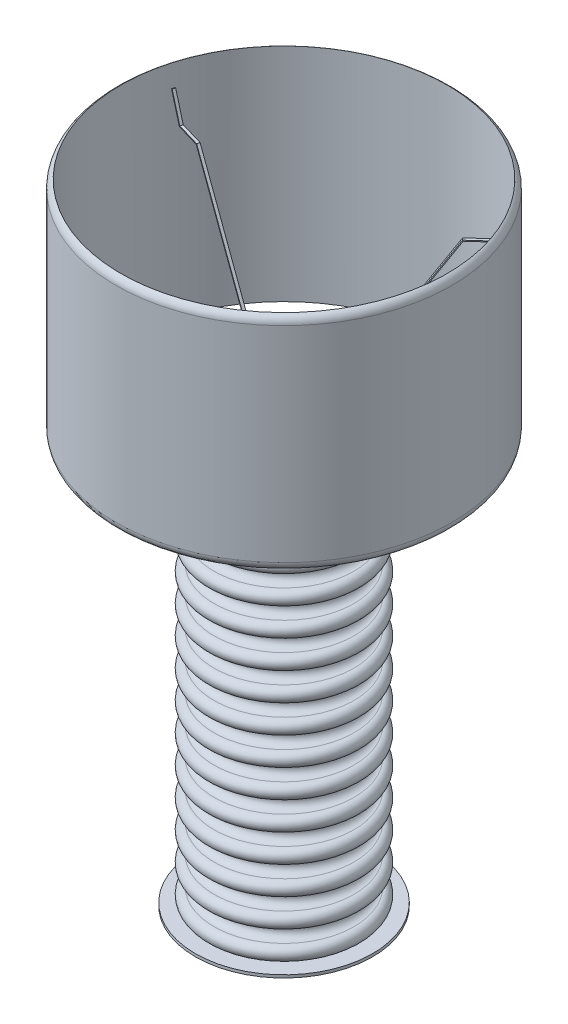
ISO-10303-21;
HEADER;
FILE_DESCRIPTION(('STEP AP214'),'2;1');
FILE_NAME('part.step','',(''),(''),'','','');
FILE_SCHEMA(('AUTOMOTIVE_DESIGN { 1 0 10303 214 1 1 1 1 }'));
ENDSEC;
DATA;
#1=APPLICATION_CONTEXT('core data for automotive mechanical design processes');
#2=APPLICATION_PROTOCOL_DEFINITION('international standard','automotive_design',2000,#1);
#3=PRODUCT_CONTEXT('',#1,'mechanical');
#4=PRODUCT('Part','Part','',(#3));
#5=PRODUCT_RELATED_PRODUCT_CATEGORY('part','',(#4));
#6=PRODUCT_DEFINITION_FORMATION('','',#4);
#7=PRODUCT_DEFINITION_CONTEXT('part definition',#1,'design');
#8=PRODUCT_DEFINITION('design','',#6,#7);
#9=PRODUCT_DEFINITION_SHAPE('','',#8);
#10=(LENGTH_UNIT() NAMED_UNIT(*) SI_UNIT(.MILLI.,.METRE.));
#11=(NAMED_UNIT(*) PLANE_ANGLE_UNIT() SI_UNIT($,.RADIAN.));
#12=(NAMED_UNIT(*) SI_UNIT($,.STERADIAN.) SOLID_ANGLE_UNIT());
#13=UNCERTAINTY_MEASURE_WITH_UNIT(LENGTH_MEASURE(1.E-05),#10,'distance_accuracy_value','');
#14=(GEOMETRIC_REPRESENTATION_CONTEXT(3) GLOBAL_UNCERTAINTY_ASSIGNED_CONTEXT((#13)) GLOBAL_UNIT_ASSIGNED_CONTEXT((#10,
#11,#12)) REPRESENTATION_CONTEXT('',''));
#15=CARTESIAN_POINT('',(0.,0.,0.));
#16=DIRECTION('',(0.,0.,1.));
#17=DIRECTION('',(1.,0.,0.));
#18=AXIS2_PLACEMENT_3D('',#15,#16,#17);
#19=CARTESIAN_POINT('',(-8.52952726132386,287.485727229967,405.));
#20=DIRECTION('',(0.,-1.,0.));
#21=DIRECTION('',(0.,0.,-1.));
#22=AXIS2_PLACEMENT_3D('',#19,#20,#21);
#23=CYLINDRICAL_SURFACE('',#22,5.);
#24=CARTESIAN_POINT('',(-8.52952726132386,287.485727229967,405.));
#25=DIRECTION('',(0.,1.,0.));
#26=DIRECTION('',(0.,0.,1.));
#27=AXIS2_PLACEMENT_3D('',#24,#25,#26);
#28=CIRCLE('',#27,5.);
#29=CARTESIAN_POINT('',(-8.52952726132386,287.485727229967,410.));
#30=VERTEX_POINT('',#29);
#31=EDGE_CURVE('P0_E10',#30,#30,#28,.T.);
#32=ORIENTED_EDGE('',*,*,#31,.F.);
#33=EDGE_LOOP('',(#32));
#34=FACE_BOUND('',#33,.T.);
#35=CARTESIAN_POINT('',(-8.52952726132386,237.485727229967,405.));
#36=DIRECTION('',(0.,1.,0.));
#37=DIRECTION('',(0.,0.,1.));
#38=AXIS2_PLACEMENT_3D('',#35,#36,#37);
#39=CIRCLE('',#38,5.);
#40=CARTESIAN_POINT('',(-8.52952726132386,237.485727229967,410.));
#41=VERTEX_POINT('',#40);
#42=EDGE_CURVE('P0_E18',#41,#41,#39,.T.);
#43=ORIENTED_EDGE('',*,*,#42,.T.);
#44=EDGE_LOOP('',(#43));
#45=FACE_BOUND('',#44,.T.);
#46=ADVANCED_FACE('P0_F15',(#34,#45),#23,.T.);
#47=CARTESIAN_POINT('',(-8.52952726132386,287.485727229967,405.));
#48=DIRECTION('',(0.,1.,0.));
#49=DIRECTION('',(0.,0.,1.));
#50=AXIS2_PLACEMENT_3D('',#47,#48,#49);
#51=PLANE('',#50);
#52=ORIENTED_EDGE('',*,*,#31,.T.);
#53=EDGE_LOOP('',(#52));
#54=FACE_BOUND('',#53,.T.);
#55=ADVANCED_FACE('P0_F30',(#54),#51,.T.);
#56=CARTESIAN_POINT('',(-8.52952726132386,237.485727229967,405.));
#57=DIRECTION('',(0.,1.,0.));
#58=DIRECTION('',(0.,0.,1.));
#59=AXIS2_PLACEMENT_3D('',#56,#57,#58);
#60=PLANE('',#59);
#61=ORIENTED_EDGE('',*,*,#42,.F.);
#62=EDGE_LOOP('',(#61));
#63=FACE_BOUND('',#62,.T.);
#64=ADVANCED_FACE('P0_F28',(#63),#60,.F.);
#65=CLOSED_SHELL('',(#46,#55,#64));
#66=MANIFOLD_SOLID_BREP('P0_B1',#65);
#67=CARTESIAN_POINT('',(-8.52952726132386,237.485727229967,405.));
#68=DIRECTION('',(0.,-1.,0.));
#69=DIRECTION('',(0.,0.,-1.));
#70=AXIS2_PLACEMENT_3D('',#67,#68,#69);
#71=CYLINDRICAL_SURFACE('',#70,80.);
#72=CARTESIAN_POINT('',(-8.52952726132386,237.485727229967,405.));
#73=DIRECTION('',(0.,1.,0.));
#74=DIRECTION('',(0.,0.,1.));
#75=AXIS2_PLACEMENT_3D('',#72,#73,#74);
#76=CIRCLE('',#75,80.);
#77=CARTESIAN_POINT('',(-8.52952726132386,237.485727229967,485.));
#78=VERTEX_POINT('',#77);
#79=EDGE_CURVE('P1_E10',#78,#78,#76,.T.);
#80=ORIENTED_EDGE('',*,*,#79,.F.);
#81=EDGE_LOOP('',(#80));
#82=FACE_BOUND('',#81,.T.);
#83=CARTESIAN_POINT('',(-8.52952726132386,234.485727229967,405.));
#84=DIRECTION('',(0.,1.,0.));
#85=DIRECTION('',(0.,0.,1.));
#86=AXIS2_PLACEMENT_3D('',#83,#84,#85);
#87=CIRCLE('',#86,80.);
#88=CARTESIAN_POINT('',(-8.52952726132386,234.485727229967,485.));
#89=VERTEX_POINT('',#88);
#90=EDGE_CURVE('P1_E18',#89,#89,#87,.T.);
#91=ORIENTED_EDGE('',*,*,#90,.T.);
#92=EDGE_LOOP('',(#91));
#93=FACE_BOUND('',#92,.T.);
#94=ADVANCED_FACE('P1_F15',(#82,#93),#71,.T.);
#95=CARTESIAN_POINT('',(-8.52952726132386,237.485727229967,405.));
#96=DIRECTION('',(0.,1.,0.));
#97=DIRECTION('',(0.,0.,1.));
#98=AXIS2_PLACEMENT_3D('',#95,#96,#97);
#99=PLANE('',#98);
#100=ORIENTED_EDGE('',*,*,#79,.T.);
#101=EDGE_LOOP('',(#100));
#102=FACE_BOUND('',#101,.T.);
#103=ADVANCED_FACE('P1_F30',(#102),#99,.T.);
#104=CARTESIAN_POINT('',(-8.52952726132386,234.485727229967,405.));
#105=DIRECTION('',(0.,1.,0.));
#106=DIRECTION('',(0.,0.,1.));
#107=AXIS2_PLACEMENT_3D('',#104,#105,#106);
#108=PLANE('',#107);
#109=ORIENTED_EDGE('',*,*,#90,.F.);
#110=EDGE_LOOP('',(#109));
#111=FACE_BOUND('',#110,.T.);
#112=ADVANCED_FACE('P1_F28',(#111),#108,.F.);
#113=CLOSED_SHELL('',(#94,#103,#112));
#114=MANIFOLD_SOLID_BREP('P1_B1',#113);
#115=CARTESIAN_POINT('',(45.9550207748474,-173.514272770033,369.553786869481));
#116=DIRECTION('',(0.,1.,0.));
#117=DIRECTION('',(0.,0.,-1.));
#118=AXIS2_PLACEMENT_3D('',#115,#116,#117);
#119=CONICAL_SURFACE('',#118,10.,0.715584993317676);
#120=CARTESIAN_POINT('',(45.9550207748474,-177.826390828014,369.553786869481));
#121=DIRECTION('',(0.,1.,0.));
#122=DIRECTION('',(0.,0.,1.));
#123=AXIS2_PLACEMENT_3D('',#120,#121,#122);
#124=CIRCLE('',#123,6.25153296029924);
#125=CARTESIAN_POINT('',(45.9550207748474,-177.826390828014,375.805319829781));
#126=VERTEX_POINT('',#125);
#127=EDGE_CURVE('P2_E10',#126,#126,#124,.T.);
#128=ORIENTED_EDGE('',*,*,#127,.T.);
#129=EDGE_LOOP('',(#128));
#130=FACE_BOUND('',#129,.T.);
#131=CARTESIAN_POINT('',(45.9550207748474,-173.514272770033,369.553786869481));
#132=DIRECTION('',(0.,-1.,0.));
#133=DIRECTION('',(0.,0.,-1.));
#134=AXIS2_PLACEMENT_3D('',#131,#132,#133);
#135=CIRCLE('',#134,10.);
#136=CARTESIAN_POINT('',(45.9550207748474,-173.514272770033,359.553786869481));
#137=VERTEX_POINT('',#136);
#138=EDGE_CURVE('P2_E26',#137,#137,#135,.T.);
#139=ORIENTED_EDGE('',*,*,#138,.T.);
#140=EDGE_LOOP('',(#139));
#141=FACE_BOUND('',#140,.T.);
#142=ADVANCED_FACE('P2_F15',(#130,#141),#119,.T.);
#143=CARTESIAN_POINT('',(-8.52952726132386,-178.514272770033,405.));
#144=DIRECTION('',(0.,-1.,0.));
#145=DIRECTION('',(0.,0.,-1.));
#146=AXIS2_PLACEMENT_3D('',#143,#144,#145);
#147=PLANE('',#146);
#148=CARTESIAN_POINT('',(45.9550207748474,-178.514272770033,369.553786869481));
#149=DIRECTION('',(0.,-1.,0.));
#150=DIRECTION('',(0.,0.,-1.));
#151=AXIS2_PLACEMENT_3D('',#148,#149,#150);
#152=CIRCLE('',#151,4.74211379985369);
#153=CARTESIAN_POINT('',(45.9550207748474,-178.514272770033,364.811673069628));
#154=VERTEX_POINT('',#153);
#155=EDGE_CURVE('P2_E22',#154,#154,#152,.T.);
#156=ORIENTED_EDGE('',*,*,#155,.T.);
#157=EDGE_LOOP('',(#156));
#158=FACE_BOUND('',#157,.T.);
#159=ADVANCED_FACE('P2_F36',(#158),#147,.T.);
#160=CARTESIAN_POINT('',(-8.52952726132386,-173.514272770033,405.));
#161=DIRECTION('',(0.,-1.,0.));
#162=DIRECTION('',(0.,0.,-1.));
#163=AXIS2_PLACEMENT_3D('',#160,#161,#162);
#164=PLANE('',#163);
#165=ORIENTED_EDGE('',*,*,#138,.F.);
#166=EDGE_LOOP('',(#165));
#167=FACE_BOUND('',#166,.T.);
#168=ADVANCED_FACE('P2_F34',(#167),#164,.F.);
#169=CARTESIAN_POINT('',(45.9550207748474,-176.514272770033,369.553786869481));
#170=DIRECTION('',(0.,-1.,0.));
#171=DIRECTION('',(0.,0.,-1.));
#172=AXIS2_PLACEMENT_3D('',#169,#170,#171);
#173=TOROIDAL_SURFACE('',#172,4.74211379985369,2.);
#174=ORIENTED_EDGE('',*,*,#127,.F.);
#175=EDGE_LOOP('',(#174));
#176=FACE_BOUND('',#175,.T.);
#177=ORIENTED_EDGE('',*,*,#155,.F.);
#178=EDGE_LOOP('',(#177));
#179=FACE_BOUND('',#178,.T.);
#180=ADVANCED_FACE('P2_F17',(#176,#179),#173,.T.);
#181=CLOSED_SHELL('',(#142,#159,#168,#180));
#182=MANIFOLD_SOLID_BREP('P2_B1',#181);
#183=CARTESIAN_POINT('',(-8.52952726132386,-173.514272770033,469.26719476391));
#184=DIRECTION('',(0.,1.,0.));
#185=DIRECTION('',(0.,0.,-1.));
#186=AXIS2_PLACEMENT_3D('',#183,#184,#185);
#187=CONICAL_SURFACE('',#186,10.,0.715584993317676);
#188=CARTESIAN_POINT('',(-8.52952726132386,-177.826390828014,469.26719476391));
#189=DIRECTION('',(0.,1.,0.));
#190=DIRECTION('',(0.,0.,1.));
#191=AXIS2_PLACEMENT_3D('',#188,#189,#190);
#192=CIRCLE('',#191,6.25153296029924);
#193=CARTESIAN_POINT('',(-8.52952726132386,-177.826390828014,475.518727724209));
#194=VERTEX_POINT('',#193);
#195=EDGE_CURVE('P3_E10',#194,#194,#192,.T.);
#196=ORIENTED_EDGE('',*,*,#195,.T.);
#197=EDGE_LOOP('',(#196));
#198=FACE_BOUND('',#197,.T.);
#199=CARTESIAN_POINT('',(-8.52952726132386,-173.514272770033,469.26719476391));
#200=DIRECTION('',(0.,-1.,0.));
#201=DIRECTION('',(0.,0.,-1.));
#202=AXIS2_PLACEMENT_3D('',#199,#200,#201);
#203=CIRCLE('',#202,10.);
#204=CARTESIAN_POINT('',(-8.52952726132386,-173.514272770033,459.26719476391));
#205=VERTEX_POINT('',#204);
#206=EDGE_CURVE('P3_E26',#205,#205,#203,.T.);
#207=ORIENTED_EDGE('',*,*,#206,.T.);
#208=EDGE_LOOP('',(#207));
#209=FACE_BOUND('',#208,.T.);
#210=ADVANCED_FACE('P3_F15',(#198,#209),#187,.T.);
#211=CARTESIAN_POINT('',(-8.52952726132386,-178.514272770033,405.));
#212=DIRECTION('',(0.,-1.,0.));
#213=DIRECTION('',(0.,0.,-1.));
#214=AXIS2_PLACEMENT_3D('',#211,#212,#213);
#215=PLANE('',#214);
#216=CARTESIAN_POINT('',(-8.52952726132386,-178.514272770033,469.26719476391));
#217=DIRECTION('',(0.,-1.,0.));
#218=DIRECTION('',(0.,0.,-1.));
#219=AXIS2_PLACEMENT_3D('',#216,#217,#218);
#220=CIRCLE('',#219,4.7421137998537);
#221=CARTESIAN_POINT('',(-8.52952726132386,-178.514272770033,464.525080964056));
#222=VERTEX_POINT('',#221);
#223=EDGE_CURVE('P3_E22',#222,#222,#220,.T.);
#224=ORIENTED_EDGE('',*,*,#223,.T.);
#225=EDGE_LOOP('',(#224));
#226=FACE_BOUND('',#225,.T.);
#227=ADVANCED_FACE('P3_F36',(#226),#215,.T.);
#228=CARTESIAN_POINT('',(-8.52952726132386,-173.514272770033,405.));
#229=DIRECTION('',(0.,-1.,0.));
#230=DIRECTION('',(0.,0.,-1.));
#231=AXIS2_PLACEMENT_3D('',#228,#229,#230);
#232=PLANE('',#231);
#233=ORIENTED_EDGE('',*,*,#206,.F.);
#234=EDGE_LOOP('',(#233));
#235=FACE_BOUND('',#234,.T.);
#236=ADVANCED_FACE('P3_F34',(#235),#232,.F.);
#237=CARTESIAN_POINT('',(-8.52952726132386,-176.514272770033,469.26719476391));
#238=DIRECTION('',(0.,-1.,0.));
#239=DIRECTION('',(0.,0.,-1.));
#240=AXIS2_PLACEMENT_3D('',#237,#238,#239);
#241=TOROIDAL_SURFACE('',#240,4.7421137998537,2.);
#242=ORIENTED_EDGE('',*,*,#195,.F.);
#243=EDGE_LOOP('',(#242));
#244=FACE_BOUND('',#243,.T.);
#245=ORIENTED_EDGE('',*,*,#223,.F.);
#246=EDGE_LOOP('',(#245));
#247=FACE_BOUND('',#246,.T.);
#248=ADVANCED_FACE('P3_F17',(#244,#247),#241,.T.);
#249=CLOSED_SHELL('',(#210,#227,#236,#248));
#250=MANIFOLD_SOLID_BREP('P3_B1',#249);
#251=CARTESIAN_POINT('',(-63.0140752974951,-173.514272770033,369.553786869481));
#252=DIRECTION('',(0.,1.,0.));
#253=DIRECTION('',(0.,0.,-1.));
#254=AXIS2_PLACEMENT_3D('',#251,#252,#253);
#255=CONICAL_SURFACE('',#254,10.,0.715584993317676);
#256=CARTESIAN_POINT('',(-63.0140752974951,-177.826390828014,369.553786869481));
#257=DIRECTION('',(0.,1.,0.));
#258=DIRECTION('',(0.,0.,1.));
#259=AXIS2_PLACEMENT_3D('',#256,#257,#258);
#260=CIRCLE('',#259,6.25153296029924);
#261=CARTESIAN_POINT('',(-63.0140752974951,-177.826390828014,375.805319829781));
#262=VERTEX_POINT('',#261);
#263=EDGE_CURVE('P4_E10',#262,#262,#260,.T.);
#264=ORIENTED_EDGE('',*,*,#263,.T.);
#265=EDGE_LOOP('',(#264));
#266=FACE_BOUND('',#265,.T.);
#267=CARTESIAN_POINT('',(-63.0140752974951,-173.514272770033,369.553786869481));
#268=DIRECTION('',(0.,-1.,0.));
#269=DIRECTION('',(0.,0.,-1.));
#270=AXIS2_PLACEMENT_3D('',#267,#268,#269);
#271=CIRCLE('',#270,10.);
#272=CARTESIAN_POINT('',(-63.0140752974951,-173.514272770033,359.553786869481));
#273=VERTEX_POINT('',#272);
#274=EDGE_CURVE('P4_E26',#273,#273,#271,.T.);
#275=ORIENTED_EDGE('',*,*,#274,.T.);
#276=EDGE_LOOP('',(#275));
#277=FACE_BOUND('',#276,.T.);
#278=ADVANCED_FACE('P4_F15',(#266,#277),#255,.T.);
#279=CARTESIAN_POINT('',(-8.52952726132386,-178.514272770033,405.));
#280=DIRECTION('',(0.,-1.,0.));
#281=DIRECTION('',(0.,0.,-1.));
#282=AXIS2_PLACEMENT_3D('',#279,#280,#281);
#283=PLANE('',#282);
#284=CARTESIAN_POINT('',(-63.0140752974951,-178.514272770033,369.553786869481));
#285=DIRECTION('',(0.,-1.,0.));
#286=DIRECTION('',(0.,0.,-1.));
#287=AXIS2_PLACEMENT_3D('',#284,#285,#286);
#288=CIRCLE('',#287,4.74211379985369);
#289=CARTESIAN_POINT('',(-63.0140752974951,-178.514272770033,364.811673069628));
#290=VERTEX_POINT('',#289);
#291=EDGE_CURVE('P4_E22',#290,#290,#288,.T.);
#292=ORIENTED_EDGE('',*,*,#291,.T.);
#293=EDGE_LOOP('',(#292));
#294=FACE_BOUND('',#293,.T.);
#295=ADVANCED_FACE('P4_F36',(#294),#283,.T.);
#296=CARTESIAN_POINT('',(-8.52952726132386,-173.514272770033,405.));
#297=DIRECTION('',(0.,-1.,0.));
#298=DIRECTION('',(0.,0.,-1.));
#299=AXIS2_PLACEMENT_3D('',#296,#297,#298);
#300=PLANE('',#299);
#301=ORIENTED_EDGE('',*,*,#274,.F.);
#302=EDGE_LOOP('',(#301));
#303=FACE_BOUND('',#302,.T.);
#304=ADVANCED_FACE('P4_F34',(#303),#300,.F.);
#305=CARTESIAN_POINT('',(-63.0140752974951,-176.514272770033,369.553786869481));
#306=DIRECTION('',(0.,-1.,0.));
#307=DIRECTION('',(0.,0.,-1.));
#308=AXIS2_PLACEMENT_3D('',#305,#306,#307);
#309=TOROIDAL_SURFACE('',#308,4.74211379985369,2.);
#310=ORIENTED_EDGE('',*,*,#263,.F.);
#311=EDGE_LOOP('',(#310));
#312=FACE_BOUND('',#311,.T.);
#313=ORIENTED_EDGE('',*,*,#291,.F.);
#314=EDGE_LOOP('',(#313));
#315=FACE_BOUND('',#314,.T.);
#316=ADVANCED_FACE('P4_F17',(#312,#315),#309,.T.);
#317=CLOSED_SHELL('',(#278,#295,#304,#316));
#318=MANIFOLD_SOLID_BREP('P4_B1',#317);
#319=CARTESIAN_POINT('',(-8.52952726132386,-170.514272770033,405.));
#320=DIRECTION('',(0.,-1.,0.));
#321=DIRECTION('',(0.,0.,-1.));
#322=AXIS2_PLACEMENT_3D('',#319,#320,#321);
#323=CYLINDRICAL_SURFACE('',#322,95.);
#324=CARTESIAN_POINT('',(-8.52952726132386,-170.514272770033,405.));
#325=DIRECTION('',(0.,1.,0.));
#326=DIRECTION('',(0.,0.,1.));
#327=AXIS2_PLACEMENT_3D('',#324,#325,#326);
#328=CIRCLE('',#327,95.);
#329=CARTESIAN_POINT('',(-8.52952726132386,-170.514272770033,500.));
#330=VERTEX_POINT('',#329);
#331=EDGE_CURVE('P5_E10',#330,#330,#328,.T.);
#332=ORIENTED_EDGE('',*,*,#331,.F.);
#333=EDGE_LOOP('',(#332));
#334=FACE_BOUND('',#333,.T.);
#335=CARTESIAN_POINT('',(-8.52952726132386,-173.514272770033,405.));
#336=DIRECTION('',(0.,1.,0.));
#337=DIRECTION('',(0.,0.,1.));
#338=AXIS2_PLACEMENT_3D('',#335,#336,#337);
#339=CIRCLE('',#338,95.);
#340=CARTESIAN_POINT('',(-8.52952726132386,-173.514272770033,500.));
#341=VERTEX_POINT('',#340);
#342=EDGE_CURVE('P5_E18',#341,#341,#339,.T.);
#343=ORIENTED_EDGE('',*,*,#342,.T.);
#344=EDGE_LOOP('',(#343));
#345=FACE_BOUND('',#344,.T.);
#346=ADVANCED_FACE('P5_F15',(#334,#345),#323,.T.);
#347=CARTESIAN_POINT('',(-8.52952726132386,-170.514272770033,405.));
#348=DIRECTION('',(0.,1.,0.));
#349=DIRECTION('',(0.,0.,1.));
#350=AXIS2_PLACEMENT_3D('',#347,#348,#349);
#351=PLANE('',#350);
#352=ORIENTED_EDGE('',*,*,#331,.T.);
#353=EDGE_LOOP('',(#352));
#354=FACE_BOUND('',#353,.T.);
#355=ADVANCED_FACE('P5_F30',(#354),#351,.T.);
#356=CARTESIAN_POINT('',(-8.52952726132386,-173.514272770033,405.));
#357=DIRECTION('',(0.,1.,0.));
#358=DIRECTION('',(0.,0.,1.));
#359=AXIS2_PLACEMENT_3D('',#356,#357,#358);
#360=PLANE('',#359);
#361=ORIENTED_EDGE('',*,*,#342,.F.);
#362=EDGE_LOOP('',(#361));
#363=FACE_BOUND('',#362,.T.);
#364=ADVANCED_FACE('P5_F28',(#363),#360,.F.);
#365=CLOSED_SHELL('',(#346,#355,#364));
#366=MANIFOLD_SOLID_BREP('P5_B1',#365);
#367=CARTESIAN_POINT('',(-8.10635573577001,262.277715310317,403.560928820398));
#368=DIRECTION('',(0.282114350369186,0.,-0.959380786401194));
#369=DIRECTION('',(-0.959380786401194,0.,-0.282114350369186));
#370=AXIS2_PLACEMENT_3D('',#367,#368,#369);
#371=PLANE('',#370);
#372=DIRECTION('',(-0.523981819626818,0.837676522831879,-0.154081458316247));
#373=VECTOR('',#372,1.);
#374=CARTESIAN_POINT('',(-138.116668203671,450.317799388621,365.330254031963));
#375=LINE('',#374,#373);
#376=CARTESIAN_POINT('',(-36.8877793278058,288.485727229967,395.097498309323));
#377=VERTEX_POINT('',#376);
#378=CARTESIAN_POINT('',(-138.116668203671,450.317799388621,365.330254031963));
#379=VERTEX_POINT('',#378);
#380=EDGE_CURVE('P6_E357',#377,#379,#375,.T.);
#381=ORIENTED_EDGE('',*,*,#380,.F.);
#382=DIRECTION('',(0.,-1.,0.));
#383=VECTOR('',#382,1.);
#384=CARTESIAN_POINT('',(-36.8877793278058,294.985727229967,395.097498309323));
#385=LINE('',#384,#383);
#386=CARTESIAN_POINT('',(-36.8877793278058,287.485727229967,395.097498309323));
#387=VERTEX_POINT('',#386);
#388=EDGE_CURVE('P6_E39',#377,#387,#385,.T.);
#389=ORIENTED_EDGE('',*,*,#388,.T.);
#390=DIRECTION('',(0.959380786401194,0.,0.282114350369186));
#391=VECTOR('',#390,1.);
#392=CARTESIAN_POINT('',(-37.4075491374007,287.485727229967,394.944655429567));
#393=LINE('',#392,#391);
#394=CARTESIAN_POINT('',(-37.4075491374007,287.485727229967,394.944655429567));
#395=VERTEX_POINT('',#394);
#396=EDGE_CURVE('P6_E362',#395,#387,#393,.T.);
#397=ORIENTED_EDGE('',*,*,#396,.F.);
#398=DIRECTION('',(0.523981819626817,-0.837676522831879,0.154081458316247));
#399=VECTOR('',#398,1.);
#400=CARTESIAN_POINT('',(-138.636438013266,449.317799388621,365.177411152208));
#401=LINE('',#400,#399);
#402=CARTESIAN_POINT('',(-138.636438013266,449.317799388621,365.177411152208));
#403=VERTEX_POINT('',#402);
#404=EDGE_CURVE('P6_E365',#403,#395,#401,.T.);
#405=ORIENTED_EDGE('',*,*,#404,.F.);
#406=DIRECTION('',(0.959380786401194,0.,0.282114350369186));
#407=VECTOR('',#406,1.);
#408=CARTESIAN_POINT('',(-164.345204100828,449.317799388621,357.617522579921));
#409=LINE('',#408,#407);
#410=CARTESIAN_POINT('',(-164.345204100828,449.317799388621,357.617522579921));
#411=VERTEX_POINT('',#410);
#412=EDGE_CURVE('P6_E367',#411,#403,#409,.T.);
#413=ORIENTED_EDGE('',*,*,#412,.F.);
#414=DIRECTION('',(0.395424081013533,-0.911108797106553,0.116277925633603));
#415=VECTOR('',#414,1.);
#416=CARTESIAN_POINT('',(-176.186106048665,476.600786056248,354.13560131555));
#417=LINE('',#416,#415);
#418=CARTESIAN_POINT('',(-175.991825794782,476.153138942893,354.192731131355));
#419=VERTEX_POINT('',#418);
#420=EDGE_CURVE('P6_E369',#419,#411,#417,.T.);
#421=ORIENTED_EDGE('',*,*,#420,.F.);
#422=DIRECTION('',(0.,1.,0.));
#423=VECTOR('',#422,1.);
#424=CARTESIAN_POINT('',(-175.991825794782,252.277715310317,354.192731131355));
#425=LINE('',#424,#423);
#426=CARTESIAN_POINT('',(-175.991825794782,477.012951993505,354.192731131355));
#427=VERTEX_POINT('',#426);
#428=EDGE_CURVE('P6_E318',#427,#419,#425,.F.);
#429=ORIENTED_EDGE('',*,*,#428,.F.);
#430=DIRECTION('',(-0.959380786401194,0.,-0.282114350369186));
#431=VECTOR('',#430,1.);
#432=CARTESIAN_POINT('',(-176.186106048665,477.012951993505,354.13560131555));
#433=LINE('',#432,#431);
#434=CARTESIAN_POINT('',(-175.3120057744,477.012951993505,354.392638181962));
#435=VERTEX_POINT('',#434);
#436=EDGE_CURVE('P6_E371',#435,#427,#433,.T.);
#437=ORIENTED_EDGE('',*,*,#436,.F.);
#438=DIRECTION('',(-0.395424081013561,0.911108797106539,-0.116277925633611));
#439=VECTOR('',#438,1.);
#440=CARTESIAN_POINT('',(-175.3120057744,477.012951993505,354.392638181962));
#441=LINE('',#440,#439);
#442=CARTESIAN_POINT('',(-163.726225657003,450.317799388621,357.799538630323));
#443=VERTEX_POINT('',#442);
#444=EDGE_CURVE('P6_E352',#443,#435,#441,.T.);
#445=ORIENTED_EDGE('',*,*,#444,.F.);
#446=DIRECTION('',(-0.959380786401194,0.,-0.282114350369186));
#447=VECTOR('',#446,1.);
#448=CARTESIAN_POINT('',(-163.726225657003,450.317799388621,357.799538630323));
#449=LINE('',#448,#447);
#450=EDGE_CURVE('P6_E355',#379,#443,#449,.T.);
#451=ORIENTED_EDGE('',*,*,#450,.F.);
#452=EDGE_LOOP('',(#381,#389,#397,#405,#413,#421,#429,#437,#445,#451));
#453=FACE_BOUND('',#452,.T.);
#454=ADVANCED_FACE('P6_F16',(#453),#371,.T.);
#455=CARTESIAN_POINT('',(-8.95269878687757,262.277715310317,406.439071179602));
#456=DIRECTION('',(0.282114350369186,0.,-0.959380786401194));
#457=DIRECTION('',(-0.959380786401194,0.,-0.282114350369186));
#458=AXIS2_PLACEMENT_3D('',#455,#456,#457);
#459=PLANE('',#458);
#460=DIRECTION('',(0.,-1.,0.));
#461=VECTOR('',#460,1.);
#462=CARTESIAN_POINT('',(-37.7341223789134,294.985727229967,397.975640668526));
#463=LINE('',#462,#461);
#464=CARTESIAN_POINT('',(-37.7341223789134,288.485727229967,397.975640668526));
#465=VERTEX_POINT('',#464);
#466=CARTESIAN_POINT('',(-37.7341223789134,287.485727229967,397.975640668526));
#467=VERTEX_POINT('',#466);
#468=EDGE_CURVE('P6_E546',#465,#467,#463,.T.);
#469=ORIENTED_EDGE('',*,*,#468,.F.);
#470=DIRECTION('',(-0.523981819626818,0.837676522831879,-0.154081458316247));
#471=VECTOR('',#470,1.);
#472=CARTESIAN_POINT('',(-138.963011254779,450.317799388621,368.208396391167));
#473=LINE('',#472,#471);
#474=CARTESIAN_POINT('',(-138.963011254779,450.317799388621,368.208396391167));
#475=VERTEX_POINT('',#474);
#476=EDGE_CURVE('P6_E378',#465,#475,#473,.T.);
#477=ORIENTED_EDGE('',*,*,#476,.T.);
#478=DIRECTION('',(-0.959380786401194,0.,-0.282114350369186));
#479=VECTOR('',#478,1.);
#480=CARTESIAN_POINT('',(-164.57256870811,450.317799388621,360.677680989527));
#481=LINE('',#480,#479);
#482=CARTESIAN_POINT('',(-164.57256870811,450.317799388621,360.677680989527));
#483=VERTEX_POINT('',#482);
#484=EDGE_CURVE('P6_E376',#475,#483,#481,.T.);
#485=ORIENTED_EDGE('',*,*,#484,.T.);
#486=DIRECTION('',(-0.395424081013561,0.911108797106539,-0.116277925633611));
#487=VECTOR('',#486,1.);
#488=CARTESIAN_POINT('',(-176.158348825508,477.012951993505,357.270780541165));
#489=LINE('',#488,#487);
#490=CARTESIAN_POINT('',(-176.158348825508,477.012951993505,357.270780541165));
#491=VERTEX_POINT('',#490);
#492=EDGE_CURVE('P6_E351',#483,#491,#489,.T.);
#493=ORIENTED_EDGE('',*,*,#492,.T.);
#494=DIRECTION('',(-0.959380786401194,0.,-0.282114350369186));
#495=VECTOR('',#494,1.);
#496=CARTESIAN_POINT('',(-177.032449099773,477.012951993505,357.013743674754));
#497=LINE('',#496,#495);
#498=CARTESIAN_POINT('',(-176.83816884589,477.012951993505,357.070873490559));
#499=VERTEX_POINT('',#498);
#500=EDGE_CURVE('P6_E354',#491,#499,#497,.T.);
#501=ORIENTED_EDGE('',*,*,#500,.T.);
#502=DIRECTION('',(0.,1.,0.));
#503=VECTOR('',#502,1.);
#504=CARTESIAN_POINT('',(-176.83816884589,252.277715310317,357.070873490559));
#505=LINE('',#504,#503);
#506=CARTESIAN_POINT('',(-176.83816884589,476.153138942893,357.070873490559));
#507=VERTEX_POINT('',#506);
#508=EDGE_CURVE('P6_E311',#499,#507,#505,.F.);
#509=ORIENTED_EDGE('',*,*,#508,.T.);
#510=DIRECTION('',(0.395424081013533,-0.911108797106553,0.116277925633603));
#511=VECTOR('',#510,1.);
#512=CARTESIAN_POINT('',(-177.032449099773,476.600786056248,357.013743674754));
#513=LINE('',#512,#511);
#514=CARTESIAN_POINT('',(-165.191547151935,449.317799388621,360.495664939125));
#515=VERTEX_POINT('',#514);
#516=EDGE_CURVE('P6_E390',#507,#515,#513,.T.);
#517=ORIENTED_EDGE('',*,*,#516,.T.);
#518=DIRECTION('',(0.959380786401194,0.,0.282114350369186));
#519=VECTOR('',#518,1.);
#520=CARTESIAN_POINT('',(-165.191547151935,449.317799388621,360.495664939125));
#521=LINE('',#520,#519);
#522=CARTESIAN_POINT('',(-139.482781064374,449.317799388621,368.055553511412));
#523=VERTEX_POINT('',#522);
#524=EDGE_CURVE('P6_E388',#515,#523,#521,.T.);
#525=ORIENTED_EDGE('',*,*,#524,.T.);
#526=DIRECTION('',(0.523981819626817,-0.837676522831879,0.154081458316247));
#527=VECTOR('',#526,1.);
#528=CARTESIAN_POINT('',(-139.482781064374,449.317799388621,368.055553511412));
#529=LINE('',#528,#527);
#530=CARTESIAN_POINT('',(-38.2538921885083,287.485727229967,397.822797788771));
#531=VERTEX_POINT('',#530);
#532=EDGE_CURVE('P6_E386',#523,#531,#529,.T.);
#533=ORIENTED_EDGE('',*,*,#532,.T.);
#534=DIRECTION('',(0.959380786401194,0.,0.282114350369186));
#535=VECTOR('',#534,1.);
#536=CARTESIAN_POINT('',(-38.2538921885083,287.485727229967,397.822797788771));
#537=LINE('',#536,#535);
#538=EDGE_CURVE('P6_E383',#531,#467,#537,.T.);
#539=ORIENTED_EDGE('',*,*,#538,.T.);
#540=EDGE_LOOP('',(#469,#477,#485,#493,#501,#509,#517,#525,#533,#539));
#541=FACE_BOUND('',#540,.T.);
#542=ADVANCED_FACE('P6_F596',(#541),#459,.F.);
#543=CARTESIAN_POINT('',(-38.2538921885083,287.485727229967,397.822797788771));
#544=DIRECTION('',(0.,1.,0.));
#545=DIRECTION('',(0.959380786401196,0.,0.282114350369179));
#546=AXIS2_PLACEMENT_3D('',#543,#544,#545);
#547=PLANE('',#546);
#548=CARTESIAN_POINT('',(-8.52952726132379,287.485727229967,405.));
#549=DIRECTION('',(0.,1.,0.));
#550=DIRECTION('',(0.959380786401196,0.,0.282114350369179));
#551=AXIS2_PLACEMENT_3D('',#548,#549,#550);
#552=CIRCLE('',#551,30.0374765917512);
#553=CARTESIAN_POINT('',(-1.52966852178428,287.485727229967,434.210477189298));
#554=VERTEX_POINT('',#553);
#555=CARTESIAN_POINT('',(-4.47834384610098,287.485727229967,434.763029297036));
#556=VERTEX_POINT('',#555);
#557=EDGE_CURVE('P6_E289',#554,#556,#552,.F.);
#558=ORIENTED_EDGE('',*,*,#557,.F.);
#559=DIRECTION('',(-0.184184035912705,0.,-0.982891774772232));
#560=VECTOR('',#559,1.);
#561=CARTESIAN_POINT('',(-1.42988196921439,287.485727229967,434.742984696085));
#562=LINE('',#561,#560);
#563=CARTESIAN_POINT('',(-1.42988196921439,287.485727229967,434.742984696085));
#564=VERTEX_POINT('',#563);
#565=EDGE_CURVE('P6_E286',#564,#554,#562,.T.);
#566=ORIENTED_EDGE('',*,*,#565,.F.);
#567=DIRECTION('',(-0.982891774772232,0.,0.184184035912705));
#568=VECTOR('',#567,1.);
#569=CARTESIAN_POINT('',(-1.42988196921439,287.485727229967,434.742984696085));
#570=LINE('',#569,#568);
#571=CARTESIAN_POINT('',(-4.37855729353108,287.485727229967,435.295536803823));
#572=VERTEX_POINT('',#571);
#573=EDGE_CURVE('P6_E476',#564,#572,#570,.T.);
#574=ORIENTED_EDGE('',*,*,#573,.T.);
#575=DIRECTION('',(-0.184184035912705,0.,-0.982891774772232));
#576=VECTOR('',#575,1.);
#577=CARTESIAN_POINT('',(-4.37855729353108,287.485727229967,435.295536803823));
#578=LINE('',#577,#576);
#579=EDGE_CURVE('P6_E497',#572,#556,#578,.T.);
#580=ORIENTED_EDGE('',*,*,#579,.T.);
#581=EDGE_LOOP('',(#558,#566,#574,#580));
#582=FACE_BOUND('',#581,.T.);
#583=ADVANCED_FACE('P6_F602',(#582),#547,.F.);
#584=EDGE_CURVE('P6_E31',#467,#387,#552,.F.);
#585=ORIENTED_EDGE('',*,*,#584,.F.);
#586=ORIENTED_EDGE('',*,*,#538,.F.);
#587=DIRECTION('',(0.282114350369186,0.,-0.959380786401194));
#588=VECTOR('',#587,1.);
#589=CARTESIAN_POINT('',(-38.2538921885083,287.485727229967,397.822797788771));
#590=LINE('',#589,#588);
#591=EDGE_CURVE('P6_E339',#531,#395,#590,.T.);
#592=ORIENTED_EDGE('',*,*,#591,.T.);
#593=ORIENTED_EDGE('',*,*,#396,.T.);
#594=EDGE_LOOP('',(#585,#586,#592,#593));
#595=FACE_BOUND('',#594,.T.);
#596=ADVANCED_FACE('P6_F756',(#595),#547,.F.);
#597=CARTESIAN_POINT('',(-7.52362388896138,262.277715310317,406.112725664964));
#598=DIRECTION('',(0.670602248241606,0.,0.741817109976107));
#599=DIRECTION('',(0.741817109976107,0.,-0.670602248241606));
#600=AXIS2_PLACEMENT_3D('',#597,#598,#599);
#601=PLANE('',#600);
#602=DIRECTION('',(0.405155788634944,0.837676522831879,-0.36626060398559));
#603=VECTOR('',#602,1.);
#604=CARTESIAN_POINT('',(93.0035866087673,450.317799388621,315.236184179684));
#605=LINE('',#604,#603);
#606=CARTESIAN_POINT('',(14.7308894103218,288.485727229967,385.994658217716));
#607=VERTEX_POINT('',#606);
#608=CARTESIAN_POINT('',(93.0035866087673,450.317799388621,315.236184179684));
#609=VERTEX_POINT('',#608);
#610=EDGE_CURVE('P6_E432',#607,#609,#605,.T.);
#611=ORIENTED_EDGE('',*,*,#610,.F.);
#612=DIRECTION('',(0.,-1.,0.));
#613=VECTOR('',#612,1.);
#614=CARTESIAN_POINT('',(14.7308894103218,294.985727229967,385.994658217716));
#615=LINE('',#614,#613);
#616=CARTESIAN_POINT('',(14.7308894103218,287.485727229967,385.994658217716));
#617=VERTEX_POINT('',#616);
#618=EDGE_CURVE('P6_E553',#607,#617,#615,.T.);
#619=ORIENTED_EDGE('',*,*,#618,.T.);
#620=DIRECTION('',(-0.741817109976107,0.,0.670602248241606));
#621=VECTOR('',#620,1.);
#622=CARTESIAN_POINT('',(15.1327883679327,287.485727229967,385.631341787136));
#623=LINE('',#622,#621);
#624=CARTESIAN_POINT('',(15.1327883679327,287.485727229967,385.631341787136));
#625=VERTEX_POINT('',#624);
#626=EDGE_CURVE('P6_E437',#625,#617,#623,.T.);
#627=ORIENTED_EDGE('',*,*,#626,.F.);
#628=DIRECTION('',(-0.405155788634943,-0.837676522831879,0.36626060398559));
#629=VECTOR('',#628,1.);
#630=CARTESIAN_POINT('',(93.4054855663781,449.317799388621,314.872867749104));
#631=LINE('',#630,#629);
#632=CARTESIAN_POINT('',(93.4054855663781,449.317799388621,314.872867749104));
#633=VERTEX_POINT('',#632);
#634=EDGE_CURVE('P6_E441',#633,#625,#631,.T.);
#635=ORIENTED_EDGE('',*,*,#634,.F.);
#636=DIRECTION('',(-0.741817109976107,0.,0.670602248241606));
#637=VECTOR('',#636,1.);
#638=CARTESIAN_POINT('',(113.28414358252,449.317799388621,296.902572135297));
#639=LINE('',#638,#637);
#640=CARTESIAN_POINT('',(113.28414358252,449.317799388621,296.902572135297));
#641=VERTEX_POINT('',#640);
#642=EDGE_CURVE('P6_E443',#641,#633,#639,.T.);
#643=ORIENTED_EDGE('',*,*,#642,.F.);
#644=DIRECTION('',(-0.30575174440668,-0.911108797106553,0.276399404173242));
#645=VECTOR('',#644,1.);
#646=CARTESIAN_POINT('',(122.439823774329,476.600786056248,288.62584241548));
#647=LINE('',#646,#645);
#648=CARTESIAN_POINT('',(122.289601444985,476.153138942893,288.761643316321));
#649=VERTEX_POINT('',#648);
#650=EDGE_CURVE('P6_E445',#649,#641,#647,.T.);
#651=ORIENTED_EDGE('',*,*,#650,.F.);
#652=DIRECTION('',(0.,1.,0.));
#653=VECTOR('',#652,1.);
#654=CARTESIAN_POINT('',(122.289601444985,252.277715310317,288.761643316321));
#655=LINE('',#654,#653);
#656=CARTESIAN_POINT('',(122.289601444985,477.012951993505,288.761643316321));
#657=VERTEX_POINT('',#656);
#658=EDGE_CURVE('P6_E295',#657,#649,#655,.F.);
#659=ORIENTED_EDGE('',*,*,#658,.F.);
#660=DIRECTION('',(0.741817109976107,0.,-0.670602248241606));
#661=VECTOR('',#660,1.);
#662=CARTESIAN_POINT('',(122.439823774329,477.012951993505,288.62584241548));
#663=LINE('',#662,#661);
#664=CARTESIAN_POINT('',(121.763947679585,477.012951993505,289.236834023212));
#665=VERTEX_POINT('',#664);
#666=EDGE_CURVE('P6_E447',#665,#657,#663,.T.);
#667=ORIENTED_EDGE('',*,*,#666,.F.);
#668=DIRECTION('',(0.305751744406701,0.911108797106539,-0.276399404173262));
#669=VECTOR('',#668,1.);
#670=CARTESIAN_POINT('',(121.763947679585,477.012951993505,289.236834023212));
#671=LINE('',#670,#669);
#672=CARTESIAN_POINT('',(112.805534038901,450.317799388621,297.335234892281));
#673=VERTEX_POINT('',#672);
#674=EDGE_CURVE('P6_E427',#673,#665,#671,.T.);
#675=ORIENTED_EDGE('',*,*,#674,.F.);
#676=DIRECTION('',(0.741817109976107,0.,-0.670602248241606));
#677=VECTOR('',#676,1.);
#678=CARTESIAN_POINT('',(112.805534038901,450.317799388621,297.335234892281));
#679=LINE('',#678,#677);
#680=EDGE_CURVE('P6_E430',#609,#673,#679,.T.);
#681=ORIENTED_EDGE('',*,*,#680,.F.);
#682=EDGE_LOOP('',(#611,#619,#627,#635,#643,#651,#659,#667,#675,#681));
#683=FACE_BOUND('',#682,.T.);
#684=ADVANCED_FACE('P6_F692',(#683),#601,.T.);
#685=CARTESIAN_POINT('',(-7.05518959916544,262.277715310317,404.723723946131));
#686=DIRECTION('',(-0.982891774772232,0.,0.184184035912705));
#687=DIRECTION('',(0.184184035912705,0.,0.982891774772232));
#688=AXIS2_PLACEMENT_3D('',#685,#686,#687);
#689=PLANE('',#688);
#690=DIRECTION('',(0.,-1.,0.));
#691=VECTOR('',#690,1.);
#692=CARTESIAN_POINT('',(-1.52966852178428,294.985727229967,434.210477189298));
#693=LINE('',#692,#691);
#694=CARTESIAN_POINT('',(-1.52966852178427,288.485727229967,434.210477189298));
#695=VERTEX_POINT('',#694);
#696=EDGE_CURVE('P6_E283',#695,#554,#693,.T.);
#697=ORIENTED_EDGE('',*,*,#696,.F.);
#698=DIRECTION('',(0.100595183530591,0.837676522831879,0.536822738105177));
#699=VECTOR('',#698,1.);
#700=CARTESIAN_POINT('',(17.9044764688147,450.317799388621,537.920123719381));
#701=LINE('',#700,#699);
#702=CARTESIAN_POINT('',(17.9044764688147,450.317799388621,537.920123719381));
#703=VERTEX_POINT('',#702);
#704=EDGE_CURVE('P6_E269',#695,#703,#701,.T.);
#705=ORIENTED_EDGE('',*,*,#704,.T.);
#706=DIRECTION('',(0.184184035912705,0.,0.982891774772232));
#707=VECTOR('',#706,1.);
#708=CARTESIAN_POINT('',(22.8210557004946,450.317799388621,564.157279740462));
#709=LINE('',#708,#707);
#710=CARTESIAN_POINT('',(22.8210557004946,450.317799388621,564.157279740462));
#711=VERTEX_POINT('',#710);
#712=EDGE_CURVE('P6_E278',#703,#711,#709,.T.);
#713=ORIENTED_EDGE('',*,*,#712,.T.);
#714=DIRECTION('',(0.075914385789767,0.911108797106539,0.405114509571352));
#715=VECTOR('',#714,1.);
#716=CARTESIAN_POINT('',(25.0453192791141,477.012951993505,576.02698584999));
#717=LINE('',#716,#715);
#718=CARTESIAN_POINT('',(25.0453192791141,477.012951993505,576.02698584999));
#719=VERTEX_POINT('',#718);
#720=EDGE_CURVE('P6_E486',#711,#719,#717,.T.);
#721=ORIENTED_EDGE('',*,*,#720,.T.);
#722=DIRECTION('',(0.184184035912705,0.,0.982891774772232));
#723=VECTOR('',#722,1.);
#724=CARTESIAN_POINT('',(25.2131309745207,477.012951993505,576.922507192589));
#725=LINE('',#724,#723);
#726=CARTESIAN_POINT('',(25.1758326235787,477.012951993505,576.723465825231));
#727=VERTEX_POINT('',#726);
#728=EDGE_CURVE('P6_E489',#719,#727,#725,.T.);
#729=ORIENTED_EDGE('',*,*,#728,.T.);
#730=DIRECTION('',(0.,1.,0.));
#731=VECTOR('',#730,1.);
#732=CARTESIAN_POINT('',(25.1758326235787,252.277715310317,576.723465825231));
#733=LINE('',#732,#731);
#734=CARTESIAN_POINT('',(25.1758326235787,476.153138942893,576.723465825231));
#735=VERTEX_POINT('',#734);
#736=EDGE_CURVE('P6_E304',#727,#735,#733,.F.);
#737=ORIENTED_EDGE('',*,*,#736,.T.);
#738=DIRECTION('',(-0.0759143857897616,-0.911108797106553,-0.405114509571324));
#739=VECTOR('',#738,1.);
#740=CARTESIAN_POINT('',(25.2131309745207,476.600786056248,576.922507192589));
#741=LINE('',#740,#739);
#742=CARTESIAN_POINT('',(22.9398885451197,449.317799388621,564.791427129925));
#743=VERTEX_POINT('',#742);
#744=EDGE_CURVE('P6_E521',#735,#743,#741,.T.);
#745=ORIENTED_EDGE('',*,*,#744,.T.);
#746=DIRECTION('',(-0.184184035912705,0.,-0.982891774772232));
#747=VECTOR('',#746,1.);
#748=CARTESIAN_POINT('',(22.9398885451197,449.317799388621,564.791427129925));
#749=LINE('',#748,#747);
#750=CARTESIAN_POINT('',(18.0042630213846,449.317799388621,538.452631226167));
#751=VERTEX_POINT('',#750);
#752=EDGE_CURVE('P6_E519',#743,#751,#749,.T.);
#753=ORIENTED_EDGE('',*,*,#752,.T.);
#754=DIRECTION('',(-0.100595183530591,-0.837676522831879,-0.536822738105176));
#755=VECTOR('',#754,1.);
#756=CARTESIAN_POINT('',(18.0042630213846,449.317799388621,538.452631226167));
#757=LINE('',#756,#755);
#758=EDGE_CURVE('P6_E517',#751,#564,#757,.T.);
#759=ORIENTED_EDGE('',*,*,#758,.T.);
#760=ORIENTED_EDGE('',*,*,#565,.T.);
#761=EDGE_LOOP('',(#697,#705,#713,#721,#729,#737,#745,#753,#759,#760));
#762=FACE_BOUND('',#761,.T.);
#763=ADVANCED_FACE('P6_F284',(#762),#689,.F.);
#764=CARTESIAN_POINT('',(-9.5354306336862,262.277715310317,403.887274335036));
#765=DIRECTION('',(0.670602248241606,0.,0.741817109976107));
#766=DIRECTION('',(0.741817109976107,0.,-0.670602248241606));
#767=AXIS2_PLACEMENT_3D('',#764,#765,#766);
#768=PLANE('',#767);
#769=DIRECTION('',(0.,-1.,0.));
#770=VECTOR('',#769,1.);
#771=CARTESIAN_POINT('',(12.719082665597,294.985727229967,383.769206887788));
#772=LINE('',#771,#770);
#773=CARTESIAN_POINT('',(12.719082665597,288.485727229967,383.769206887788));
#774=VERTEX_POINT('',#773);
#775=CARTESIAN_POINT('',(12.719082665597,287.485727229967,383.769206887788));
#776=VERTEX_POINT('',#775);
#777=EDGE_CURVE('P6_E555',#774,#776,#772,.T.);
#778=ORIENTED_EDGE('',*,*,#777,.F.);
#779=DIRECTION('',(0.405155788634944,0.837676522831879,-0.36626060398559));
#780=VECTOR('',#779,1.);
#781=CARTESIAN_POINT('',(90.9917798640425,450.317799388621,313.010732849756));
#782=LINE('',#781,#780);
#783=CARTESIAN_POINT('',(90.9917798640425,450.317799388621,313.010732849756));
#784=VERTEX_POINT('',#783);
#785=EDGE_CURVE('P6_E454',#774,#784,#782,.T.);
#786=ORIENTED_EDGE('',*,*,#785,.T.);
#787=DIRECTION('',(0.741817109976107,0.,-0.670602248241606));
#788=VECTOR('',#787,1.);
#789=CARTESIAN_POINT('',(110.793727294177,450.317799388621,295.109783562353));
#790=LINE('',#789,#788);
#791=CARTESIAN_POINT('',(110.793727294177,450.317799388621,295.109783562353));
#792=VERTEX_POINT('',#791);
#793=EDGE_CURVE('P6_E452',#784,#792,#790,.T.);
#794=ORIENTED_EDGE('',*,*,#793,.T.);
#795=DIRECTION('',(0.305751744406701,0.911108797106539,-0.276399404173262));
#796=VECTOR('',#795,1.);
#797=CARTESIAN_POINT('',(119.752140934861,477.012951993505,287.011382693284));
#798=LINE('',#797,#796);
#799=CARTESIAN_POINT('',(119.752140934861,477.012951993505,287.011382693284));
#800=VERTEX_POINT('',#799);
#801=EDGE_CURVE('P6_E426',#792,#800,#798,.T.);
#802=ORIENTED_EDGE('',*,*,#801,.T.);
#803=DIRECTION('',(0.741817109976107,0.,-0.670602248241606));
#804=VECTOR('',#803,1.);
#805=CARTESIAN_POINT('',(120.428017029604,477.012951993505,286.400391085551));
#806=LINE('',#805,#804);
#807=CARTESIAN_POINT('',(120.27779470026,477.012951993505,286.536191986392));
#808=VERTEX_POINT('',#807);
#809=EDGE_CURVE('P6_E429',#800,#808,#806,.T.);
#810=ORIENTED_EDGE('',*,*,#809,.T.);
#811=DIRECTION('',(0.,1.,0.));
#812=VECTOR('',#811,1.);
#813=CARTESIAN_POINT('',(120.27779470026,252.277715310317,286.536191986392));
#814=LINE('',#813,#812);
#815=CARTESIAN_POINT('',(120.27779470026,476.153138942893,286.536191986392));
#816=VERTEX_POINT('',#815);
#817=EDGE_CURVE('P6_E374',#808,#816,#814,.F.);
#818=ORIENTED_EDGE('',*,*,#817,.T.);
#819=DIRECTION('',(-0.30575174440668,-0.911108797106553,0.276399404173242));
#820=VECTOR('',#819,1.);
#821=CARTESIAN_POINT('',(120.428017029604,476.600786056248,286.400391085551));
#822=LINE('',#821,#820);
#823=CARTESIAN_POINT('',(111.272336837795,449.317799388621,294.677120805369));
#824=VERTEX_POINT('',#823);
#825=EDGE_CURVE('P6_E467',#816,#824,#822,.T.);
#826=ORIENTED_EDGE('',*,*,#825,.T.);
#827=DIRECTION('',(-0.741817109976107,0.,0.670602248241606));
#828=VECTOR('',#827,1.);
#829=CARTESIAN_POINT('',(111.272336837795,449.317799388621,294.677120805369));
#830=LINE('',#829,#828);
#831=CARTESIAN_POINT('',(91.3936788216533,449.317799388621,312.647416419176));
#832=VERTEX_POINT('',#831);
#833=EDGE_CURVE('P6_E465',#824,#832,#830,.T.);
#834=ORIENTED_EDGE('',*,*,#833,.T.);
#835=DIRECTION('',(-0.405155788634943,-0.837676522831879,0.36626060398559));
#836=VECTOR('',#835,1.);
#837=CARTESIAN_POINT('',(91.3936788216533,449.317799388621,312.647416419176));
#838=LINE('',#837,#836);
#839=CARTESIAN_POINT('',(13.1209816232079,287.485727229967,383.405890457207));
#840=VERTEX_POINT('',#839);
#841=EDGE_CURVE('P6_E463',#832,#840,#838,.T.);
#842=ORIENTED_EDGE('',*,*,#841,.T.);
#843=DIRECTION('',(-0.741817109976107,0.,0.670602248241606));
#844=VECTOR('',#843,1.);
#845=CARTESIAN_POINT('',(13.1209816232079,287.485727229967,383.405890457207));
#846=LINE('',#845,#844);
#847=EDGE_CURVE('P6_E459',#840,#776,#846,.T.);
#848=ORIENTED_EDGE('',*,*,#847,.T.);
#849=EDGE_LOOP('',(#778,#786,#794,#802,#810,#818,#826,#834,#842,#848));
#850=FACE_BOUND('',#849,.T.);
#851=ADVANCED_FACE('P6_F689',(#850),#768,.F.);
#852=CARTESIAN_POINT('',(-10.0038649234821,262.277715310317,405.276276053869));
#853=DIRECTION('',(-0.982891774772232,0.,0.184184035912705));
#854=DIRECTION('',(0.184184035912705,0.,0.982891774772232));
#855=AXIS2_PLACEMENT_3D('',#852,#853,#854);
#856=PLANE('',#855);
#857=DIRECTION('',(0.100595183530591,0.837676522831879,0.536822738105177));
#858=VECTOR('',#857,1.);
#859=CARTESIAN_POINT('',(14.955801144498,450.317799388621,538.472675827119));
#860=LINE('',#859,#858);
#861=CARTESIAN_POINT('',(-4.47834384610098,288.485727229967,434.763029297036));
#862=VERTEX_POINT('',#861);
#863=CARTESIAN_POINT('',(14.955801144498,450.317799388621,538.472675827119));
#864=VERTEX_POINT('',#863);
#865=EDGE_CURVE('P6_E492',#862,#864,#860,.T.);
#866=ORIENTED_EDGE('',*,*,#865,.F.);
#867=DIRECTION('',(0.,-1.,0.));
#868=VECTOR('',#867,1.);
#869=CARTESIAN_POINT('',(-4.47834384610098,294.985727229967,434.763029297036));
#870=LINE('',#869,#868);
#871=EDGE_CURVE('P6_E290',#862,#556,#870,.T.);
#872=ORIENTED_EDGE('',*,*,#871,.T.);
#873=ORIENTED_EDGE('',*,*,#579,.F.);
#874=DIRECTION('',(-0.100595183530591,-0.837676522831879,-0.536822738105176));
#875=VECTOR('',#874,1.);
#876=CARTESIAN_POINT('',(15.0555876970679,449.317799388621,539.005183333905));
#877=LINE('',#876,#875);
#878=CARTESIAN_POINT('',(15.0555876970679,449.317799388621,539.005183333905));
#879=VERTEX_POINT('',#878);
#880=EDGE_CURVE('P6_E501',#879,#572,#877,.T.);
#881=ORIENTED_EDGE('',*,*,#880,.F.);
#882=DIRECTION('',(-0.184184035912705,0.,-0.982891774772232));
#883=VECTOR('',#882,1.);
#884=CARTESIAN_POINT('',(19.9912132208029,449.317799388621,565.343979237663));
#885=LINE('',#884,#883);
#886=CARTESIAN_POINT('',(19.9912132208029,449.317799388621,565.343979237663));
#887=VERTEX_POINT('',#886);
#888=EDGE_CURVE('P6_E503',#887,#879,#885,.T.);
#889=ORIENTED_EDGE('',*,*,#888,.F.);
#890=DIRECTION('',(-0.0759143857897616,-0.911108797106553,-0.405114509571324));
#891=VECTOR('',#890,1.);
#892=CARTESIAN_POINT('',(22.264455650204,476.600786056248,577.475059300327));
#893=LINE('',#892,#891);
#894=CARTESIAN_POINT('',(22.227157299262,476.153138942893,577.276017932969));
#895=VERTEX_POINT('',#894);
#896=EDGE_CURVE('P6_E505',#895,#887,#893,.T.);
#897=ORIENTED_EDGE('',*,*,#896,.F.);
#898=DIRECTION('',(0.,1.,0.));
#899=VECTOR('',#898,1.);
#900=CARTESIAN_POINT('',(22.227157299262,252.277715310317,577.276017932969));
#901=LINE('',#900,#899);
#902=CARTESIAN_POINT('',(22.227157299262,477.012951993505,577.276017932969));
#903=VERTEX_POINT('',#902);
#904=EDGE_CURVE('P6_E399',#903,#895,#901,.F.);
#905=ORIENTED_EDGE('',*,*,#904,.F.);
#906=DIRECTION('',(0.184184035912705,0.,0.982891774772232));
#907=VECTOR('',#906,1.);
#908=CARTESIAN_POINT('',(22.2644556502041,477.012951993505,577.475059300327));
#909=LINE('',#908,#907);
#910=CARTESIAN_POINT('',(22.0966439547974,477.012951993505,576.579537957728));
#911=VERTEX_POINT('',#910);
#912=EDGE_CURVE('P6_E507',#911,#903,#909,.T.);
#913=ORIENTED_EDGE('',*,*,#912,.F.);
#914=DIRECTION('',(0.075914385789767,0.911108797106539,0.405114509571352));
#915=VECTOR('',#914,1.);
#916=CARTESIAN_POINT('',(22.0966439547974,477.012951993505,576.579537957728));
#917=LINE('',#916,#915);
#918=CARTESIAN_POINT('',(19.8723803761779,450.317799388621,564.7098318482));
#919=VERTEX_POINT('',#918);
#920=EDGE_CURVE('P6_E487',#919,#911,#917,.T.);
#921=ORIENTED_EDGE('',*,*,#920,.F.);
#922=DIRECTION('',(0.184184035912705,0.,0.982891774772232));
#923=VECTOR('',#922,1.);
#924=CARTESIAN_POINT('',(19.8723803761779,450.317799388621,564.7098318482));
#925=LINE('',#924,#923);
#926=EDGE_CURVE('P6_E490',#864,#919,#925,.T.);
#927=ORIENTED_EDGE('',*,*,#926,.F.);
#928=EDGE_LOOP('',(#866,#872,#873,#881,#889,#897,#905,#913,#921,#927));
#929=FACE_BOUND('',#928,.T.);
#930=ADVANCED_FACE('P6_F809',(#929),#856,.T.);
#931=CARTESIAN_POINT('',(-8.52952726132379,252.277715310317,405.));
#932=DIRECTION('',(0.,1.,0.));
#933=DIRECTION('',(0.959380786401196,0.,0.282114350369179));
#934=AXIS2_PLACEMENT_3D('',#931,#932,#933);
#935=CYLINDRICAL_SURFACE('',#934,175.);
#936=CARTESIAN_POINT('',(-8.52952726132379,477.012951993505,405.));
#937=DIRECTION('',(0.,-1.,0.));
#938=DIRECTION('',(-0.959380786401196,0.,-0.282114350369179));
#939=AXIS2_PLACEMENT_3D('',#936,#937,#938);
#940=CIRCLE('',#939,175.);
#941=EDGE_CURVE('P6_E296',#657,#808,#940,.F.);
#942=ORIENTED_EDGE('',*,*,#941,.F.);
#943=ORIENTED_EDGE('',*,*,#658,.T.);
#944=CARTESIAN_POINT('',(-8.52952726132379,89.3230594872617,405.));
#945=DIRECTION('',(-0.67587609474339,0.412165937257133,0.610991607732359));
#946=DIRECTION('',(0.30575174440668,0.911108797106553,-0.276399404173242));
#947=AXIS2_PLACEMENT_3D('',#944,#945,#946);
#948=ELLIPSE('',#947,424.586275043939,175.);
#949=EDGE_CURVE('P6_E301',#816,#649,#948,.F.);
#950=ORIENTED_EDGE('',*,*,#949,.F.);
#951=ORIENTED_EDGE('',*,*,#817,.F.);
#952=EDGE_LOOP('',(#942,#943,#950,#951));
#953=FACE_BOUND('',#952,.T.);
#954=ORIENTED_EDGE('',*,*,#508,.F.);
#955=CARTESIAN_POINT('',(-8.52952726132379,477.012951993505,405.));
#956=DIRECTION('',(0.,-1.,0.));
#957=DIRECTION('',(-0.959380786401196,0.,-0.282114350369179));
#958=AXIS2_PLACEMENT_3D('',#955,#956,#957);
#959=CIRCLE('',#958,175.);
#960=EDGE_CURVE('P6_E313',#427,#499,#959,.F.);
#961=ORIENTED_EDGE('',*,*,#960,.F.);
#962=ORIENTED_EDGE('',*,*,#428,.T.);
#963=CARTESIAN_POINT('',(-8.52952726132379,89.3230594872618,405.));
#964=DIRECTION('',(0.87410027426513,0.412165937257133,0.257036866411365));
#965=DIRECTION('',(-0.395424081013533,0.911108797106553,-0.116277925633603));
#966=AXIS2_PLACEMENT_3D('',#963,#964,#965);
#967=ELLIPSE('',#966,424.586275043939,175.);
#968=EDGE_CURVE('P6_E315',#507,#419,#967,.F.);
#969=ORIENTED_EDGE('',*,*,#968,.F.);
#970=EDGE_LOOP('',(#954,#961,#962,#969));
#971=FACE_BOUND('',#970,.T.);
#972=CARTESIAN_POINT('',(-8.52952726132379,263.617461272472,405.));
#973=DIRECTION('',(0.,1.,0.));
#974=DIRECTION('',(0.959380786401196,0.,0.282114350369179));
#975=AXIS2_PLACEMENT_3D('',#972,#973,#974);
#976=CIRCLE('',#975,175.);
#977=CARTESIAN_POINT('',(159.362110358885,263.617461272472,454.370011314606));
#978=VERTEX_POINT('',#977);
#979=EDGE_CURVE('P6_E325',#978,#978,#976,.F.);
#980=ORIENTED_EDGE('',*,*,#979,.T.);
#981=EDGE_LOOP('',(#980));
#982=FACE_BOUND('',#981,.T.);
#983=CARTESIAN_POINT('',(-8.52952726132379,500.937969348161,405.));
#984=DIRECTION('',(0.,-1.,0.));
#985=DIRECTION('',(-0.959380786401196,0.,-0.282114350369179));
#986=AXIS2_PLACEMENT_3D('',#983,#984,#985);
#987=CIRCLE('',#986,175.);
#988=CARTESIAN_POINT('',(-176.421164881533,500.937969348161,355.629988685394));
#989=VERTEX_POINT('',#988);
#990=EDGE_CURVE('P6_E322',#989,#989,#987,.F.);
#991=ORIENTED_EDGE('',*,*,#990,.T.);
#992=EDGE_LOOP('',(#991));
#993=FACE_BOUND('',#992,.T.);
#994=ORIENTED_EDGE('',*,*,#736,.F.);
#995=CARTESIAN_POINT('',(-8.52952726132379,477.012951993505,405.));
#996=DIRECTION('',(0.,-1.,0.));
#997=DIRECTION('',(-0.959380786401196,0.,-0.282114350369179));
#998=AXIS2_PLACEMENT_3D('',#995,#996,#997);
#999=CIRCLE('',#998,175.);
#1000=EDGE_CURVE('P6_E306',#903,#727,#999,.F.);
#1001=ORIENTED_EDGE('',*,*,#1000,.F.);
#1002=ORIENTED_EDGE('',*,*,#904,.T.);
#1003=CARTESIAN_POINT('',(-8.52952726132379,89.3230594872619,405.));
#1004=DIRECTION('',(-0.167811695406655,0.412165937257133,-0.895521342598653));
#1005=DIRECTION('',(0.0759143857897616,0.911108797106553,0.405114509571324));
#1006=AXIS2_PLACEMENT_3D('',#1003,#1004,#1005);
#1007=ELLIPSE('',#1006,424.586275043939,175.);
#1008=EDGE_CURVE('P6_E308',#735,#895,#1007,.F.);
#1009=ORIENTED_EDGE('',*,*,#1008,.F.);
#1010=EDGE_LOOP('',(#994,#1001,#1002,#1009));
#1011=FACE_BOUND('',#1010,.T.);
#1012=ADVANCED_FACE('P6_F734',(#953,#971,#982,#993,#1011),#935,.F.);
#1013=CARTESIAN_POINT('',(-8.52952726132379,502.277715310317,405.));
#1014=DIRECTION('',(0.,-1.,0.));
#1015=DIRECTION('',(-0.959380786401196,0.,-0.282114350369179));
#1016=AXIS2_PLACEMENT_3D('',#1013,#1014,#1015);
#1017=CYLINDRICAL_SURFACE('',#1016,180.);
#1018=CARTESIAN_POINT('',(-8.52952726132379,272.277715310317,405.));
#1019=DIRECTION('',(0.,1.,0.));
#1020=DIRECTION('',(0.959380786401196,0.,0.282114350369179));
#1021=AXIS2_PLACEMENT_3D('',#1018,#1019,#1020);
#1022=CIRCLE('',#1021,180.);
#1023=CARTESIAN_POINT('',(164.159014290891,272.277715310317,455.780583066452));
#1024=VERTEX_POINT('',#1023);
#1025=EDGE_CURVE('P6_E321',#1024,#1024,#1022,.T.);
#1026=ORIENTED_EDGE('',*,*,#1025,.T.);
#1027=EDGE_LOOP('',(#1026));
#1028=FACE_BOUND('',#1027,.T.);
#1029=CARTESIAN_POINT('',(-8.52952726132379,492.277715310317,405.));
#1030=DIRECTION('',(0.,1.,0.));
#1031=DIRECTION('',(0.959380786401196,0.,0.282114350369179));
#1032=AXIS2_PLACEMENT_3D('',#1029,#1030,#1031);
#1033=CIRCLE('',#1032,180.);
#1034=CARTESIAN_POINT('',(164.159014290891,492.277715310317,455.780583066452));
#1035=VERTEX_POINT('',#1034);
#1036=EDGE_CURVE('P6_E329',#1035,#1035,#1033,.F.);
#1037=ORIENTED_EDGE('',*,*,#1036,.T.);
#1038=EDGE_LOOP('',(#1037));
#1039=FACE_BOUND('',#1038,.T.);
#1040=ADVANCED_FACE('P6_F808',(#1028,#1039),#1017,.T.);
#1041=CARTESIAN_POINT('',(-8.52952726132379,272.277715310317,405.));
#1042=DIRECTION('',(0.,1.,0.));
#1043=DIRECTION('',(0.959380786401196,0.,0.282114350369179));
#1044=AXIS2_PLACEMENT_3D('',#1041,#1042,#1043);
#1045=TOROIDAL_SURFACE('',#1044,170.,10.);
#1046=ORIENTED_EDGE('',*,*,#979,.F.);
#1047=EDGE_LOOP('',(#1046));
#1048=FACE_BOUND('',#1047,.T.);
#1049=ORIENTED_EDGE('',*,*,#1025,.F.);
#1050=EDGE_LOOP('',(#1049));
#1051=FACE_BOUND('',#1050,.T.);
#1052=ADVANCED_FACE('P6_F811',(#1048,#1051),#1045,.T.);
#1053=CARTESIAN_POINT('',(-8.52952726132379,492.277715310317,405.));
#1054=DIRECTION('',(0.,1.,0.));
#1055=DIRECTION('',(0.959380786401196,0.,0.282114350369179));
#1056=AXIS2_PLACEMENT_3D('',#1053,#1054,#1055);
#1057=TOROIDAL_SURFACE('',#1056,170.,10.);
#1058=ORIENTED_EDGE('',*,*,#990,.F.);
#1059=EDGE_LOOP('',(#1058));
#1060=FACE_BOUND('',#1059,.T.);
#1061=ORIENTED_EDGE('',*,*,#1036,.F.);
#1062=EDGE_LOOP('',(#1061));
#1063=FACE_BOUND('',#1062,.T.);
#1064=ADVANCED_FACE('P6_F18',(#1060,#1063),#1057,.T.);
#1065=CARTESIAN_POINT('',(-177.032449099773,477.012951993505,357.013743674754));
#1066=DIRECTION('',(0.,-1.,0.));
#1067=DIRECTION('',(-0.959380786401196,0.,-0.282114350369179));
#1068=AXIS2_PLACEMENT_3D('',#1065,#1066,#1067);
#1069=PLANE('',#1068);
#1070=ORIENTED_EDGE('',*,*,#436,.T.);
#1071=ORIENTED_EDGE('',*,*,#960,.T.);
#1072=ORIENTED_EDGE('',*,*,#500,.F.);
#1073=DIRECTION('',(0.282114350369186,0.,-0.959380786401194));
#1074=VECTOR('',#1073,1.);
#1075=CARTESIAN_POINT('',(-176.158348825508,477.012951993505,357.270780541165));
#1076=LINE('',#1075,#1074);
#1077=EDGE_CURVE('P6_E348',#491,#435,#1076,.T.);
#1078=ORIENTED_EDGE('',*,*,#1077,.T.);
#1079=EDGE_LOOP('',(#1070,#1071,#1072,#1078));
#1080=FACE_BOUND('',#1079,.T.);
#1081=ADVANCED_FACE('P6_F774',(#1080),#1069,.F.);
#1082=CARTESIAN_POINT('',(-177.032449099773,476.600786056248,357.013743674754));
#1083=DIRECTION('',(0.87410027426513,0.412165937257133,0.257036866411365));
#1084=DIRECTION('',(0.395424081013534,-0.911108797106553,0.1162779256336));
#1085=AXIS2_PLACEMENT_3D('',#1082,#1083,#1084);
#1086=PLANE('',#1085);
#1087=ORIENTED_EDGE('',*,*,#516,.F.);
#1088=ORIENTED_EDGE('',*,*,#968,.T.);
#1089=ORIENTED_EDGE('',*,*,#420,.T.);
#1090=DIRECTION('',(0.282114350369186,0.,-0.959380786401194));
#1091=VECTOR('',#1090,1.);
#1092=CARTESIAN_POINT('',(-165.191547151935,449.317799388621,360.495664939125));
#1093=LINE('',#1092,#1091);
#1094=EDGE_CURVE('P6_E326',#515,#411,#1093,.T.);
#1095=ORIENTED_EDGE('',*,*,#1094,.F.);
#1096=EDGE_LOOP('',(#1087,#1088,#1089,#1095));
#1097=FACE_BOUND('',#1096,.T.);
#1098=ADVANCED_FACE('P6_F768',(#1097),#1086,.F.);
#1099=CARTESIAN_POINT('',(-165.191547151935,449.317799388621,360.495664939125));
#1100=DIRECTION('',(0.,1.,0.));
#1101=DIRECTION('',(0.959380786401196,0.,0.282114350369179));
#1102=AXIS2_PLACEMENT_3D('',#1099,#1100,#1101);
#1103=PLANE('',#1102);
#1104=ORIENTED_EDGE('',*,*,#412,.T.);
#1105=DIRECTION('',(0.282114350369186,0.,-0.959380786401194));
#1106=VECTOR('',#1105,1.);
#1107=CARTESIAN_POINT('',(-139.482781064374,449.317799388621,368.055553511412));
#1108=LINE('',#1107,#1106);
#1109=EDGE_CURVE('P6_E336',#523,#403,#1108,.T.);
#1110=ORIENTED_EDGE('',*,*,#1109,.F.);
#1111=ORIENTED_EDGE('',*,*,#524,.F.);
#1112=ORIENTED_EDGE('',*,*,#1094,.T.);
#1113=EDGE_LOOP('',(#1104,#1110,#1111,#1112));
#1114=FACE_BOUND('',#1113,.T.);
#1115=ADVANCED_FACE('P6_F764',(#1114),#1103,.F.);
#1116=CARTESIAN_POINT('',(-139.482781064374,449.317799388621,368.055553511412));
#1117=DIRECTION('',(0.803650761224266,0.546166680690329,0.236320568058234));
#1118=DIRECTION('',(0.523981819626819,-0.837676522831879,0.154081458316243));
#1119=AXIS2_PLACEMENT_3D('',#1116,#1117,#1118);
#1120=PLANE('',#1119);
#1121=ORIENTED_EDGE('',*,*,#404,.T.);
#1122=ORIENTED_EDGE('',*,*,#591,.F.);
#1123=ORIENTED_EDGE('',*,*,#532,.F.);
#1124=ORIENTED_EDGE('',*,*,#1109,.T.);
#1125=EDGE_LOOP('',(#1121,#1122,#1123,#1124));
#1126=FACE_BOUND('',#1125,.T.);
#1127=ADVANCED_FACE('P6_F760',(#1126),#1120,.F.);
#1128=EDGE_CURVE('P6_E552',#776,#617,#552,.F.);
#1129=ORIENTED_EDGE('',*,*,#1128,.F.);
#1130=ORIENTED_EDGE('',*,*,#847,.F.);
#1131=DIRECTION('',(0.670602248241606,0.,0.741817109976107));
#1132=VECTOR('',#1131,1.);
#1133=CARTESIAN_POINT('',(13.1209816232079,287.485727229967,383.405890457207));
#1134=LINE('',#1133,#1132);
#1135=EDGE_CURVE('P6_E414',#840,#625,#1134,.T.);
#1136=ORIENTED_EDGE('',*,*,#1135,.T.);
#1137=ORIENTED_EDGE('',*,*,#626,.T.);
#1138=EDGE_LOOP('',(#1129,#1130,#1136,#1137));
#1139=FACE_BOUND('',#1138,.T.);
#1140=ADVANCED_FACE('P6_F787',(#1139),#547,.F.);
#1141=CARTESIAN_POINT('',(-138.963011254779,450.317799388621,368.208396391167));
#1142=DIRECTION('',(-0.803650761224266,-0.546166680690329,-0.236320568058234));
#1143=DIRECTION('',(-0.523981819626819,0.837676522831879,-0.154081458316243));
#1144=AXIS2_PLACEMENT_3D('',#1141,#1142,#1143);
#1145=PLANE('',#1144);
#1146=CARTESIAN_POINT('',(-8.52952726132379,242.473591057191,405.));
#1147=DIRECTION('',(-0.803650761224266,-0.546166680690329,-0.236320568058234));
#1148=DIRECTION('',(0.523981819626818,-0.837676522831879,0.154081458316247));
#1149=AXIS2_PLACEMENT_3D('',#1146,#1147,#1148);
#1150=ELLIPSE('',#1149,54.9969041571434,30.0374765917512);
#1151=EDGE_CURVE('P6_E549',#377,#465,#1150,.F.);
#1152=ORIENTED_EDGE('',*,*,#1151,.F.);
#1153=ORIENTED_EDGE('',*,*,#380,.T.);
#1154=DIRECTION('',(0.282114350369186,0.,-0.959380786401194));
#1155=VECTOR('',#1154,1.);
#1156=CARTESIAN_POINT('',(-138.963011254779,450.317799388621,368.208396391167));
#1157=LINE('',#1156,#1155);
#1158=EDGE_CURVE('P6_E342',#475,#379,#1157,.T.);
#1159=ORIENTED_EDGE('',*,*,#1158,.F.);
#1160=ORIENTED_EDGE('',*,*,#476,.F.);
#1161=EDGE_LOOP('',(#1152,#1153,#1159,#1160));
#1162=FACE_BOUND('',#1161,.T.);
#1163=ADVANCED_FACE('P6_F785',(#1162),#1145,.F.);
#1164=CARTESIAN_POINT('',(-164.57256870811,450.317799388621,360.677680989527));
#1165=DIRECTION('',(0.,-1.,0.));
#1166=DIRECTION('',(-0.959380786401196,0.,-0.282114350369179));
#1167=AXIS2_PLACEMENT_3D('',#1164,#1165,#1166);
#1168=PLANE('',#1167);
#1169=ORIENTED_EDGE('',*,*,#450,.T.);
#1170=DIRECTION('',(0.282114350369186,0.,-0.959380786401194));
#1171=VECTOR('',#1170,1.);
#1172=CARTESIAN_POINT('',(-164.57256870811,450.317799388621,360.677680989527));
#1173=LINE('',#1172,#1171);
#1174=EDGE_CURVE('P6_E345',#483,#443,#1173,.T.);
#1175=ORIENTED_EDGE('',*,*,#1174,.F.);
#1176=ORIENTED_EDGE('',*,*,#484,.F.);
#1177=ORIENTED_EDGE('',*,*,#1158,.T.);
#1178=EDGE_LOOP('',(#1169,#1175,#1176,#1177));
#1179=FACE_BOUND('',#1178,.T.);
#1180=ADVANCED_FACE('P6_F721',(#1179),#1168,.F.);
#1181=CARTESIAN_POINT('',(-176.158348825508,477.012951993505,357.270780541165));
#1182=DIRECTION('',(-0.874100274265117,-0.412165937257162,-0.257036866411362));
#1183=DIRECTION('',(-0.395424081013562,0.911108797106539,-0.116277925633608));
#1184=AXIS2_PLACEMENT_3D('',#1181,#1182,#1183);
#1185=PLANE('',#1184);
#1186=ORIENTED_EDGE('',*,*,#444,.T.);
#1187=ORIENTED_EDGE('',*,*,#1077,.F.);
#1188=ORIENTED_EDGE('',*,*,#492,.F.);
#1189=ORIENTED_EDGE('',*,*,#1174,.T.);
#1190=EDGE_LOOP('',(#1186,#1187,#1188,#1189));
#1191=FACE_BOUND('',#1190,.T.);
#1192=ADVANCED_FACE('P6_F716',(#1191),#1185,.F.);
#1193=CARTESIAN_POINT('',(120.428017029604,477.012951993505,286.400391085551));
#1194=DIRECTION('',(0.,-1.,0.));
#1195=DIRECTION('',(-0.959380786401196,0.,-0.282114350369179));
#1196=AXIS2_PLACEMENT_3D('',#1193,#1194,#1195);
#1197=PLANE('',#1196);
#1198=ORIENTED_EDGE('',*,*,#666,.T.);
#1199=ORIENTED_EDGE('',*,*,#941,.T.);
#1200=ORIENTED_EDGE('',*,*,#809,.F.);
#1201=DIRECTION('',(0.670602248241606,0.,0.741817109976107));
#1202=VECTOR('',#1201,1.);
#1203=CARTESIAN_POINT('',(119.752140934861,477.012951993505,287.011382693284));
#1204=LINE('',#1203,#1202);
#1205=EDGE_CURVE('P6_E423',#800,#665,#1204,.T.);
#1206=ORIENTED_EDGE('',*,*,#1205,.T.);
#1207=EDGE_LOOP('',(#1198,#1199,#1200,#1206));
#1208=FACE_BOUND('',#1207,.T.);
#1209=ADVANCED_FACE('P6_F713',(#1208),#1197,.F.);
#1210=CARTESIAN_POINT('',(120.428017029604,476.600786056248,286.400391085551));
#1211=DIRECTION('',(-0.67587609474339,0.412165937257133,0.610991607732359));
#1212=DIRECTION('',(0.670602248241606,0.,0.741817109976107));
#1213=AXIS2_PLACEMENT_3D('',#1210,#1211,#1212);
#1214=PLANE('',#1213);
#1215=ORIENTED_EDGE('',*,*,#825,.F.);
#1216=ORIENTED_EDGE('',*,*,#949,.T.);
#1217=ORIENTED_EDGE('',*,*,#650,.T.);
#1218=DIRECTION('',(0.670602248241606,0.,0.741817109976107));
#1219=VECTOR('',#1218,1.);
#1220=CARTESIAN_POINT('',(111.272336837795,449.317799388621,294.677120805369));
#1221=LINE('',#1220,#1219);
#1222=EDGE_CURVE('P6_E408',#824,#641,#1221,.T.);
#1223=ORIENTED_EDGE('',*,*,#1222,.F.);
#1224=EDGE_LOOP('',(#1215,#1216,#1217,#1223));
#1225=FACE_BOUND('',#1224,.T.);
#1226=ADVANCED_FACE('P6_F685',(#1225),#1214,.F.);
#1227=CARTESIAN_POINT('',(25.2131309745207,477.012951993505,576.922507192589));
#1228=DIRECTION('',(0.,-1.,0.));
#1229=DIRECTION('',(-0.959380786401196,0.,-0.282114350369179));
#1230=AXIS2_PLACEMENT_3D('',#1227,#1228,#1229);
#1231=PLANE('',#1230);
#1232=ORIENTED_EDGE('',*,*,#912,.T.);
#1233=ORIENTED_EDGE('',*,*,#1000,.T.);
#1234=ORIENTED_EDGE('',*,*,#728,.F.);
#1235=DIRECTION('',(-0.982891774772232,0.,0.184184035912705));
#1236=VECTOR('',#1235,1.);
#1237=CARTESIAN_POINT('',(25.0453192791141,477.012951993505,576.02698584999));
#1238=LINE('',#1237,#1236);
#1239=EDGE_CURVE('P6_E483',#719,#911,#1238,.T.);
#1240=ORIENTED_EDGE('',*,*,#1239,.T.);
#1241=EDGE_LOOP('',(#1232,#1233,#1234,#1240));
#1242=FACE_BOUND('',#1241,.T.);
#1243=ADVANCED_FACE('P6_F681',(#1242),#1231,.F.);
#1244=CARTESIAN_POINT('',(25.2131309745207,476.600786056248,576.922507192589));
#1245=DIRECTION('',(-0.167811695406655,0.412165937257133,-0.895521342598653));
#1246=DIRECTION('',(-0.982891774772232,0.,0.184184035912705));
#1247=AXIS2_PLACEMENT_3D('',#1244,#1245,#1246);
#1248=PLANE('',#1247);
#1249=ORIENTED_EDGE('',*,*,#744,.F.);
#1250=ORIENTED_EDGE('',*,*,#1008,.T.);
#1251=ORIENTED_EDGE('',*,*,#896,.T.);
#1252=DIRECTION('',(-0.982891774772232,0.,0.184184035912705));
#1253=VECTOR('',#1252,1.);
#1254=CARTESIAN_POINT('',(22.9398885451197,449.317799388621,564.791427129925));
#1255=LINE('',#1254,#1253);
#1256=EDGE_CURVE('P6_E450',#743,#887,#1255,.T.);
#1257=ORIENTED_EDGE('',*,*,#1256,.F.);
#1258=EDGE_LOOP('',(#1249,#1250,#1251,#1257));
#1259=FACE_BOUND('',#1258,.T.);
#1260=ADVANCED_FACE('P6_F677',(#1259),#1248,.F.);
#1261=CARTESIAN_POINT('',(111.272336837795,449.317799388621,294.677120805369));
#1262=DIRECTION('',(0.,1.,0.));
#1263=DIRECTION('',(0.959380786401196,0.,0.282114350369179));
#1264=AXIS2_PLACEMENT_3D('',#1261,#1262,#1263);
#1265=PLANE('',#1264);
#1266=ORIENTED_EDGE('',*,*,#642,.T.);
#1267=DIRECTION('',(0.670602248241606,0.,0.741817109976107));
#1268=VECTOR('',#1267,1.);
#1269=CARTESIAN_POINT('',(91.3936788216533,449.317799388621,312.647416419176));
#1270=LINE('',#1269,#1268);
#1271=EDGE_CURVE('P6_E411',#832,#633,#1270,.T.);
#1272=ORIENTED_EDGE('',*,*,#1271,.F.);
#1273=ORIENTED_EDGE('',*,*,#833,.F.);
#1274=ORIENTED_EDGE('',*,*,#1222,.T.);
#1275=EDGE_LOOP('',(#1266,#1272,#1273,#1274));
#1276=FACE_BOUND('',#1275,.T.);
#1277=ADVANCED_FACE('P6_F680',(#1276),#1265,.F.);
#1278=CARTESIAN_POINT('',(91.3936788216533,449.317799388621,312.647416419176));
#1279=DIRECTION('',(-0.621402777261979,0.546166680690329,0.561747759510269));
#1280=DIRECTION('',(-0.17136756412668,-0.794365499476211,0.582766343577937));
#1281=AXIS2_PLACEMENT_3D('',#1278,#1279,#1280);
#1282=PLANE('',#1281);
#1283=ORIENTED_EDGE('',*,*,#634,.T.);
#1284=ORIENTED_EDGE('',*,*,#1135,.F.);
#1285=ORIENTED_EDGE('',*,*,#841,.F.);
#1286=ORIENTED_EDGE('',*,*,#1271,.T.);
#1287=EDGE_LOOP('',(#1283,#1284,#1285,#1286));
#1288=FACE_BOUND('',#1287,.T.);
#1289=ADVANCED_FACE('P6_F703',(#1288),#1282,.F.);
#1290=CARTESIAN_POINT('',(90.9917798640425,450.317799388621,313.010732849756));
#1291=DIRECTION('',(0.621402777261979,-0.546166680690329,-0.561747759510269));
#1292=DIRECTION('',(0.17136756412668,0.794365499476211,-0.582766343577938));
#1293=AXIS2_PLACEMENT_3D('',#1290,#1291,#1292);
#1294=PLANE('',#1293);
#1295=CARTESIAN_POINT('',(-8.52952726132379,242.473591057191,405.));
#1296=DIRECTION('',(0.621402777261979,-0.546166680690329,-0.561747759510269));
#1297=DIRECTION('',(-0.405155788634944,-0.837676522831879,0.36626060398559));
#1298=AXIS2_PLACEMENT_3D('',#1295,#1296,#1297);
#1299=ELLIPSE('',#1298,54.9969041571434,30.0374765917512);
#1300=EDGE_CURVE('P6_E558',#607,#774,#1299,.F.);
#1301=ORIENTED_EDGE('',*,*,#1300,.F.);
#1302=ORIENTED_EDGE('',*,*,#610,.T.);
#1303=DIRECTION('',(0.670602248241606,0.,0.741817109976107));
#1304=VECTOR('',#1303,1.);
#1305=CARTESIAN_POINT('',(90.9917798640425,450.317799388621,313.010732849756));
#1306=LINE('',#1305,#1304);
#1307=EDGE_CURVE('P6_E417',#784,#609,#1306,.T.);
#1308=ORIENTED_EDGE('',*,*,#1307,.F.);
#1309=ORIENTED_EDGE('',*,*,#785,.F.);
#1310=EDGE_LOOP('',(#1301,#1302,#1308,#1309));
#1311=FACE_BOUND('',#1310,.T.);
#1312=ADVANCED_FACE('P6_F699',(#1311),#1294,.F.);
#1313=CARTESIAN_POINT('',(110.793727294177,450.317799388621,295.109783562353));
#1314=DIRECTION('',(0.,-1.,0.));
#1315=DIRECTION('',(0.282114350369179,0.,-0.959380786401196));
#1316=AXIS2_PLACEMENT_3D('',#1313,#1314,#1315);
#1317=PLANE('',#1316);
#1318=ORIENTED_EDGE('',*,*,#680,.T.);
#1319=DIRECTION('',(0.670602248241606,0.,0.741817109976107));
#1320=VECTOR('',#1319,1.);
#1321=CARTESIAN_POINT('',(110.793727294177,450.317799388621,295.109783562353));
#1322=LINE('',#1321,#1320);
#1323=EDGE_CURVE('P6_E420',#792,#673,#1322,.T.);
#1324=ORIENTED_EDGE('',*,*,#1323,.F.);
#1325=ORIENTED_EDGE('',*,*,#793,.F.);
#1326=ORIENTED_EDGE('',*,*,#1307,.T.);
#1327=EDGE_LOOP('',(#1318,#1324,#1325,#1326));
#1328=FACE_BOUND('',#1327,.T.);
#1329=ADVANCED_FACE('P6_F695',(#1328),#1317,.F.);
#1330=CARTESIAN_POINT('',(119.752140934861,477.012951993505,287.011382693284));
#1331=DIRECTION('',(0.675876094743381,-0.412165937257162,-0.610991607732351));
#1332=DIRECTION('',(-0.670602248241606,0.,-0.741817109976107));
#1333=AXIS2_PLACEMENT_3D('',#1330,#1331,#1332);
#1334=PLANE('',#1333);
#1335=ORIENTED_EDGE('',*,*,#674,.T.);
#1336=ORIENTED_EDGE('',*,*,#1205,.F.);
#1337=ORIENTED_EDGE('',*,*,#801,.F.);
#1338=ORIENTED_EDGE('',*,*,#1323,.T.);
#1339=EDGE_LOOP('',(#1335,#1336,#1337,#1338));
#1340=FACE_BOUND('',#1339,.T.);
#1341=ADVANCED_FACE('P6_F675',(#1340),#1334,.F.);
#1342=CARTESIAN_POINT('',(22.9398885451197,449.317799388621,564.791427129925));
#1343=DIRECTION('',(0.,1.,0.));
#1344=DIRECTION('',(0.959380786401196,0.,0.282114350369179));
#1345=AXIS2_PLACEMENT_3D('',#1342,#1343,#1344);
#1346=PLANE('',#1345);
#1347=ORIENTED_EDGE('',*,*,#888,.T.);
#1348=DIRECTION('',(-0.982891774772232,0.,0.184184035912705));
#1349=VECTOR('',#1348,1.);
#1350=CARTESIAN_POINT('',(18.0042630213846,449.317799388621,538.452631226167));
#1351=LINE('',#1350,#1349);
#1352=EDGE_CURVE('P6_E473',#751,#879,#1351,.T.);
#1353=ORIENTED_EDGE('',*,*,#1352,.F.);
#1354=ORIENTED_EDGE('',*,*,#752,.F.);
#1355=ORIENTED_EDGE('',*,*,#1256,.T.);
#1356=EDGE_LOOP('',(#1347,#1353,#1354,#1355));
#1357=FACE_BOUND('',#1356,.T.);
#1358=ADVANCED_FACE('P6_F671',(#1357),#1346,.F.);
#1359=CARTESIAN_POINT('',(18.0042630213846,449.317799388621,538.452631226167));
#1360=DIRECTION('',(-0.154286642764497,0.546166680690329,-0.823345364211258));
#1361=DIRECTION('',(-0.166598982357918,0.807010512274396,0.566549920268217));
#1362=AXIS2_PLACEMENT_3D('',#1359,#1360,#1361);
#1363=PLANE('',#1362);
#1364=ORIENTED_EDGE('',*,*,#880,.T.);
#1365=ORIENTED_EDGE('',*,*,#573,.F.);
#1366=ORIENTED_EDGE('',*,*,#758,.F.);
#1367=ORIENTED_EDGE('',*,*,#1352,.T.);
#1368=EDGE_LOOP('',(#1364,#1365,#1366,#1367));
#1369=FACE_BOUND('',#1368,.T.);
#1370=ADVANCED_FACE('P6_F668',(#1369),#1363,.F.);
#1371=CARTESIAN_POINT('',(17.9044764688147,450.317799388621,537.920123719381));
#1372=DIRECTION('',(0.154286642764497,-0.546166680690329,0.823345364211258));
#1373=DIRECTION('',(0.166598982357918,-0.807010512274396,-0.566549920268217));
#1374=AXIS2_PLACEMENT_3D('',#1371,#1372,#1373);
#1375=PLANE('',#1374);
#1376=CARTESIAN_POINT('',(-8.52952726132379,242.473591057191,405.));
#1377=DIRECTION('',(0.154286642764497,-0.546166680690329,0.823345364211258));
#1378=DIRECTION('',(-0.100595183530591,-0.837676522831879,-0.536822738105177));
#1379=AXIS2_PLACEMENT_3D('',#1376,#1377,#1378);
#1380=ELLIPSE('',#1379,54.9969041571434,30.0374765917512);
#1381=EDGE_CURVE('P6_E24',#862,#695,#1380,.F.);
#1382=ORIENTED_EDGE('',*,*,#1381,.F.);
#1383=ORIENTED_EDGE('',*,*,#865,.T.);
#1384=DIRECTION('',(-0.982891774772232,0.,0.184184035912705));
#1385=VECTOR('',#1384,1.);
#1386=CARTESIAN_POINT('',(17.9044764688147,450.317799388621,537.920123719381));
#1387=LINE('',#1386,#1385);
#1388=EDGE_CURVE('P6_E275',#703,#864,#1387,.T.);
#1389=ORIENTED_EDGE('',*,*,#1388,.F.);
#1390=ORIENTED_EDGE('',*,*,#704,.F.);
#1391=EDGE_LOOP('',(#1382,#1383,#1389,#1390));
#1392=FACE_BOUND('',#1391,.T.);
#1393=ADVANCED_FACE('P6_F271',(#1392),#1375,.F.);
#1394=CARTESIAN_POINT('',(22.8210557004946,450.317799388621,564.157279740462));
#1395=DIRECTION('',(0.,-1.,0.));
#1396=DIRECTION('',(0.282114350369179,0.,-0.959380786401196));
#1397=AXIS2_PLACEMENT_3D('',#1394,#1395,#1396);
#1398=PLANE('',#1397);
#1399=ORIENTED_EDGE('',*,*,#926,.T.);
#1400=DIRECTION('',(-0.982891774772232,0.,0.184184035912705));
#1401=VECTOR('',#1400,1.);
#1402=CARTESIAN_POINT('',(22.8210557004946,450.317799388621,564.157279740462));
#1403=LINE('',#1402,#1401);
#1404=EDGE_CURVE('P6_E480',#711,#919,#1403,.T.);
#1405=ORIENTED_EDGE('',*,*,#1404,.F.);
#1406=ORIENTED_EDGE('',*,*,#712,.F.);
#1407=ORIENTED_EDGE('',*,*,#1388,.T.);
#1408=EDGE_LOOP('',(#1399,#1405,#1406,#1407));
#1409=FACE_BOUND('',#1408,.T.);
#1410=ADVANCED_FACE('P6_F654',(#1409),#1398,.F.);
#1411=CARTESIAN_POINT('',(25.0453192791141,477.012951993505,576.02698584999));
#1412=DIRECTION('',(0.167811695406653,-0.412165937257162,0.89552134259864));
#1413=DIRECTION('',(0.982891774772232,0.,-0.184184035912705));
#1414=AXIS2_PLACEMENT_3D('',#1411,#1412,#1413);
#1415=PLANE('',#1414);
#1416=ORIENTED_EDGE('',*,*,#920,.T.);
#1417=ORIENTED_EDGE('',*,*,#1239,.F.);
#1418=ORIENTED_EDGE('',*,*,#720,.F.);
#1419=ORIENTED_EDGE('',*,*,#1404,.T.);
#1420=EDGE_LOOP('',(#1416,#1417,#1418,#1419));
#1421=FACE_BOUND('',#1420,.T.);
#1422=ADVANCED_FACE('P6_F650',(#1421),#1415,.F.);
#1423=CARTESIAN_POINT('',(-8.52952726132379,294.985727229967,405.));
#1424=DIRECTION('',(0.,-1.,0.));
#1425=DIRECTION('',(-0.959380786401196,0.,-0.282114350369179));
#1426=AXIS2_PLACEMENT_3D('',#1423,#1424,#1425);
#1427=CYLINDRICAL_SURFACE('',#1426,25.3116720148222);
#1428=DIRECTION('',(0.,-1.,0.));
#1429=VECTOR('',#1428,1.);
#1430=CARTESIAN_POINT('',(-2.4013771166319,294.985727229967,429.558634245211));
#1431=LINE('',#1430,#1429);
#1432=CARTESIAN_POINT('',(-2.40137711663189,288.485727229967,429.558634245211));
#1433=VERTEX_POINT('',#1432);
#1434=CARTESIAN_POINT('',(-2.4013771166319,287.485727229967,429.558634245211));
#1435=VERTEX_POINT('',#1434);
#1436=EDGE_CURVE('P6_E538',#1433,#1435,#1431,.T.);
#1437=ORIENTED_EDGE('',*,*,#1436,.F.);
#1438=CARTESIAN_POINT('',(-8.52952726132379,288.485727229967,405.));
#1439=DIRECTION('',(0.,-1.,0.));
#1440=DIRECTION('',(-0.959380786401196,0.,-0.282114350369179));
#1441=AXIS2_PLACEMENT_3D('',#1438,#1439,#1440);
#1442=CIRCLE('',#1441,25.3116720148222);
#1443=CARTESIAN_POINT('',(-5.35005244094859,288.485727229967,430.111186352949));
#1444=VERTEX_POINT('',#1443);
#1445=EDGE_CURVE('P6_E543',#1444,#1433,#1442,.F.);
#1446=ORIENTED_EDGE('',*,*,#1445,.F.);
#1447=DIRECTION('',(0.,-1.,0.));
#1448=VECTOR('',#1447,1.);
#1449=CARTESIAN_POINT('',(-5.35005244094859,294.985727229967,430.111186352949));
#1450=LINE('',#1449,#1448);
#1451=CARTESIAN_POINT('',(-5.35005244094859,287.485727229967,430.111186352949));
#1452=VERTEX_POINT('',#1451);
#1453=EDGE_CURVE('P6_E10',#1444,#1452,#1450,.T.);
#1454=ORIENTED_EDGE('',*,*,#1453,.T.);
#1455=CARTESIAN_POINT('',(-8.52952726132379,287.485727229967,405.));
#1456=DIRECTION('',(0.,1.,0.));
#1457=DIRECTION('',(0.959380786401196,0.,0.282114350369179));
#1458=AXIS2_PLACEMENT_3D('',#1455,#1456,#1457);
#1459=CIRCLE('',#1458,25.3116720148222);
#1460=EDGE_CURVE('P6_E540',#1435,#1452,#1459,.F.);
#1461=ORIENTED_EDGE('',*,*,#1460,.F.);
#1462=EDGE_LOOP('',(#1437,#1446,#1454,#1461));
#1463=FACE_BOUND('',#1462,.T.);
#1464=CARTESIAN_POINT('',(-8.52952726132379,294.985727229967,405.));
#1465=DIRECTION('',(0.,1.,0.));
#1466=DIRECTION('',(0.959380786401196,0.,0.282114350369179));
#1467=AXIS2_PLACEMENT_3D('',#1464,#1465,#1466);
#1468=CIRCLE('',#1467,25.3116720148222);
#1469=CARTESIAN_POINT('',(15.7540045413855,294.985727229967,412.140785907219));
#1470=VERTEX_POINT('',#1469);
#1471=EDGE_CURVE('P6_E567',#1470,#1470,#1468,.T.);
#1472=ORIENTED_EDGE('',*,*,#1471,.T.);
#1473=EDGE_LOOP('',(#1472));
#1474=FACE_BOUND('',#1473,.T.);
#1475=CARTESIAN_POINT('',(-8.52952726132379,281.985727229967,405.));
#1476=DIRECTION('',(0.,1.,0.));
#1477=DIRECTION('',(0.959380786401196,0.,0.282114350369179));
#1478=AXIS2_PLACEMENT_3D('',#1475,#1476,#1477);
#1479=CIRCLE('',#1478,25.3116720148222);
#1480=CARTESIAN_POINT('',(15.7540045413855,281.985727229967,412.140785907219));
#1481=VERTEX_POINT('',#1480);
#1482=EDGE_CURVE('P6_E570',#1481,#1481,#1479,.T.);
#1483=ORIENTED_EDGE('',*,*,#1482,.F.);
#1484=EDGE_LOOP('',(#1483));
#1485=FACE_BOUND('',#1484,.T.);
#1486=CARTESIAN_POINT('',(11.2200077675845,288.485727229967,389.168493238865));
#1487=VERTEX_POINT('',#1486);
#1488=CARTESIAN_POINT('',(9.20820102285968,288.485727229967,386.943041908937));
#1489=VERTEX_POINT('',#1488);
#1490=EDGE_CURVE('P6_E537',#1487,#1489,#1442,.F.);
#1491=ORIENTED_EDGE('',*,*,#1490,.F.);
#1492=DIRECTION('',(0.,-1.,0.));
#1493=VECTOR('',#1492,1.);
#1494=CARTESIAN_POINT('',(11.2200077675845,294.985727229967,389.168493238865));
#1495=LINE('',#1494,#1493);
#1496=CARTESIAN_POINT('',(11.2200077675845,287.485727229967,389.168493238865));
#1497=VERTEX_POINT('',#1496);
#1498=EDGE_CURVE('P6_E531',#1487,#1497,#1495,.T.);
#1499=ORIENTED_EDGE('',*,*,#1498,.T.);
#1500=CARTESIAN_POINT('',(9.20820102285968,287.485727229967,386.943041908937));
#1501=VERTEX_POINT('',#1500);
#1502=EDGE_CURVE('P6_E533',#1501,#1497,#1459,.F.);
#1503=ORIENTED_EDGE('',*,*,#1502,.F.);
#1504=DIRECTION('',(0.,-1.,0.));
#1505=VECTOR('',#1504,1.);
#1506=CARTESIAN_POINT('',(9.20820102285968,294.985727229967,386.943041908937));
#1507=LINE('',#1506,#1505);
#1508=EDGE_CURVE('P6_E534',#1489,#1501,#1507,.T.);
#1509=ORIENTED_EDGE('',*,*,#1508,.F.);
#1510=EDGE_LOOP('',(#1491,#1499,#1503,#1509));
#1511=FACE_BOUND('',#1510,.T.);
#1512=CARTESIAN_POINT('',(-33.1935525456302,287.485727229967,399.310835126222));
#1513=VERTEX_POINT('',#1512);
#1514=CARTESIAN_POINT('',(-32.3472094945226,287.485727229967,396.432692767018));
#1515=VERTEX_POINT('',#1514);
#1516=EDGE_CURVE('P6_E510',#1513,#1515,#1459,.F.);
#1517=ORIENTED_EDGE('',*,*,#1516,.F.);
#1518=DIRECTION('',(0.,-1.,0.));
#1519=VECTOR('',#1518,1.);
#1520=CARTESIAN_POINT('',(-33.1935525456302,294.985727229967,399.310835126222));
#1521=LINE('',#1520,#1519);
#1522=CARTESIAN_POINT('',(-33.1935525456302,288.485727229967,399.310835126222));
#1523=VERTEX_POINT('',#1522);
#1524=EDGE_CURVE('P6_E527',#1523,#1513,#1521,.T.);
#1525=ORIENTED_EDGE('',*,*,#1524,.F.);
#1526=CARTESIAN_POINT('',(-32.3472094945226,288.485727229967,396.432692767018));
#1527=VERTEX_POINT('',#1526);
#1528=EDGE_CURVE('P6_E530',#1527,#1523,#1442,.F.);
#1529=ORIENTED_EDGE('',*,*,#1528,.F.);
#1530=DIRECTION('',(0.,-1.,0.));
#1531=VECTOR('',#1530,1.);
#1532=CARTESIAN_POINT('',(-32.3472094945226,294.985727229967,396.432692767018));
#1533=LINE('',#1532,#1531);
#1534=EDGE_CURVE('P6_E525',#1527,#1515,#1533,.T.);
#1535=ORIENTED_EDGE('',*,*,#1534,.T.);
#1536=EDGE_LOOP('',(#1517,#1525,#1529,#1535));
#1537=FACE_BOUND('',#1536,.T.);
#1538=ADVANCED_FACE('P6_F576',(#1463,#1474,#1485,#1511,#1537),#1427,.F.);
#1539=CARTESIAN_POINT('',(-8.52952726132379,294.985727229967,405.));
#1540=DIRECTION('',(0.,-1.,0.));
#1541=DIRECTION('',(-0.959380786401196,0.,-0.282114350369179));
#1542=AXIS2_PLACEMENT_3D('',#1539,#1540,#1541);
#1543=CYLINDRICAL_SURFACE('',#1542,30.0374765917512);
#1544=CARTESIAN_POINT('',(-8.52952726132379,294.985727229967,405.));
#1545=DIRECTION('',(0.,1.,0.));
#1546=DIRECTION('',(0.959380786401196,0.,0.282114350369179));
#1547=AXIS2_PLACEMENT_3D('',#1544,#1545,#1546);
#1548=CIRCLE('',#1547,30.0374765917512);
#1549=CARTESIAN_POINT('',(20.287850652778,294.985727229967,413.474003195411));
#1550=VERTEX_POINT('',#1549);
#1551=EDGE_CURVE('P6_E563',#1550,#1550,#1548,.T.);
#1552=ORIENTED_EDGE('',*,*,#1551,.F.);
#1553=EDGE_LOOP('',(#1552));
#1554=FACE_BOUND('',#1553,.T.);
#1555=CARTESIAN_POINT('',(-8.52952726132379,281.985727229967,405.));
#1556=DIRECTION('',(0.,1.,0.));
#1557=DIRECTION('',(0.959380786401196,0.,0.282114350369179));
#1558=AXIS2_PLACEMENT_3D('',#1555,#1556,#1557);
#1559=CIRCLE('',#1558,30.0374765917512);
#1560=CARTESIAN_POINT('',(20.287850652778,281.985727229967,413.474003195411));
#1561=VERTEX_POINT('',#1560);
#1562=EDGE_CURVE('P6_E564',#1561,#1561,#1559,.T.);
#1563=ORIENTED_EDGE('',*,*,#1562,.T.);
#1564=EDGE_LOOP('',(#1563));
#1565=FACE_BOUND('',#1564,.T.);
#1566=ORIENTED_EDGE('',*,*,#696,.T.);
#1567=ORIENTED_EDGE('',*,*,#557,.T.);
#1568=ORIENTED_EDGE('',*,*,#871,.F.);
#1569=ORIENTED_EDGE('',*,*,#1381,.T.);
#1570=EDGE_LOOP('',(#1566,#1567,#1568,#1569));
#1571=FACE_BOUND('',#1570,.T.);
#1572=ORIENTED_EDGE('',*,*,#777,.T.);
#1573=ORIENTED_EDGE('',*,*,#1128,.T.);
#1574=ORIENTED_EDGE('',*,*,#618,.F.);
#1575=ORIENTED_EDGE('',*,*,#1300,.T.);
#1576=EDGE_LOOP('',(#1572,#1573,#1574,#1575));
#1577=FACE_BOUND('',#1576,.T.);
#1578=ORIENTED_EDGE('',*,*,#468,.T.);
#1579=ORIENTED_EDGE('',*,*,#584,.T.);
#1580=ORIENTED_EDGE('',*,*,#388,.F.);
#1581=ORIENTED_EDGE('',*,*,#1151,.T.);
#1582=EDGE_LOOP('',(#1578,#1579,#1580,#1581));
#1583=FACE_BOUND('',#1582,.T.);
#1584=ADVANCED_FACE('P6_F293',(#1554,#1565,#1571,#1577,#1583),#1543,.T.);
#1585=CARTESIAN_POINT('',(-8.52952726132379,294.985727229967,405.));
#1586=DIRECTION('',(0.,1.,0.));
#1587=DIRECTION('',(0.959380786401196,0.,0.282114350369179));
#1588=AXIS2_PLACEMENT_3D('',#1585,#1586,#1587);
#1589=PLANE('',#1588);
#1590=ORIENTED_EDGE('',*,*,#1551,.T.);
#1591=EDGE_LOOP('',(#1590));
#1592=FACE_BOUND('',#1591,.T.);
#1593=ORIENTED_EDGE('',*,*,#1471,.F.);
#1594=EDGE_LOOP('',(#1593));
#1595=FACE_BOUND('',#1594,.T.);
#1596=ADVANCED_FACE('P6_F579',(#1592,#1595),#1589,.T.);
#1597=CARTESIAN_POINT('',(-8.52952726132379,281.985727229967,405.));
#1598=DIRECTION('',(0.,1.,0.));
#1599=DIRECTION('',(0.959380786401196,0.,0.282114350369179));
#1600=AXIS2_PLACEMENT_3D('',#1597,#1598,#1599);
#1601=PLANE('',#1600);
#1602=ORIENTED_EDGE('',*,*,#1562,.F.);
#1603=EDGE_LOOP('',(#1602));
#1604=FACE_BOUND('',#1603,.T.);
#1605=ORIENTED_EDGE('',*,*,#1482,.T.);
#1606=EDGE_LOOP('',(#1605));
#1607=FACE_BOUND('',#1606,.T.);
#1608=ADVANCED_FACE('P6_F581',(#1604,#1607),#1601,.F.);
#1609=DIRECTION('',(0.741817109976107,0.,-0.670602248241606));
#1610=VECTOR('',#1609,1.);
#1611=CARTESIAN_POINT('',(12.719082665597,288.485727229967,383.769206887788));
#1612=LINE('',#1611,#1610);
#1613=CARTESIAN_POINT('',(-8.91227431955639,288.485727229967,403.323941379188));
#1614=VERTEX_POINT('',#1613);
#1615=EDGE_CURVE('P6_E456',#1614,#1489,#1612,.T.);
#1616=ORIENTED_EDGE('',*,*,#1615,.T.);
#1617=ORIENTED_EDGE('',*,*,#1508,.T.);
#1618=CARTESIAN_POINT('',(-8.91227431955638,287.485727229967,403.323941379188));
#1619=VERTEX_POINT('',#1618);
#1620=EDGE_CURVE('P6_E462',#1501,#1619,#846,.T.);
#1621=ORIENTED_EDGE('',*,*,#1620,.T.);
#1622=DIRECTION('',(0.,-1.,0.));
#1623=VECTOR('',#1622,1.);
#1624=CARTESIAN_POINT('',(-8.91227431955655,262.277715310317,403.323941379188));
#1625=LINE('',#1624,#1623);
#1626=EDGE_CURVE('P6_E396',#1614,#1619,#1625,.T.);
#1627=ORIENTED_EDGE('',*,*,#1626,.F.);
#1628=EDGE_LOOP('',(#1616,#1617,#1621,#1627));
#1629=FACE_BOUND('',#1628,.T.);
#1630=ADVANCED_FACE('P6_F589',(#1629),#768,.F.);
#1631=DIRECTION('',(0.184184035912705,0.,0.982891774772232));
#1632=VECTOR('',#1631,1.);
#1633=CARTESIAN_POINT('',(-1.52966852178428,288.485727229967,434.210477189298));
#1634=LINE('',#1633,#1632);
#1635=CARTESIAN_POINT('',(-6.90046757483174,288.485727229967,405.549392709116));
#1636=VERTEX_POINT('',#1635);
#1637=EDGE_CURVE('P6_E279',#1636,#1433,#1634,.T.);
#1638=ORIENTED_EDGE('',*,*,#1637,.T.);
#1639=ORIENTED_EDGE('',*,*,#1436,.T.);
#1640=CARTESIAN_POINT('',(-6.90046757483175,287.485727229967,405.549392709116));
#1641=VERTEX_POINT('',#1640);
#1642=EDGE_CURVE('P6_E516',#1435,#1641,#562,.T.);
#1643=ORIENTED_EDGE('',*,*,#1642,.T.);
#1644=DIRECTION('',(0.,-1.,0.));
#1645=VECTOR('',#1644,1.);
#1646=CARTESIAN_POINT('',(-6.90046757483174,262.277715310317,405.549392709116));
#1647=LINE('',#1646,#1645);
#1648=EDGE_CURVE('P6_E405',#1636,#1641,#1647,.T.);
#1649=ORIENTED_EDGE('',*,*,#1648,.F.);
#1650=EDGE_LOOP('',(#1638,#1639,#1643,#1649));
#1651=FACE_BOUND('',#1650,.T.);
#1652=ADVANCED_FACE('P6_F643',(#1651),#689,.F.);
#1653=ORIENTED_EDGE('',*,*,#1498,.F.);
#1654=DIRECTION('',(0.741817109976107,0.,-0.670602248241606));
#1655=VECTOR('',#1654,1.);
#1656=CARTESIAN_POINT('',(14.7308894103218,288.485727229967,385.994658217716));
#1657=LINE('',#1656,#1655);
#1658=EDGE_CURVE('P6_E434',#1636,#1487,#1657,.T.);
#1659=ORIENTED_EDGE('',*,*,#1658,.F.);
#1660=ORIENTED_EDGE('',*,*,#1648,.T.);
#1661=EDGE_CURVE('P6_E440',#1497,#1641,#623,.T.);
#1662=ORIENTED_EDGE('',*,*,#1661,.F.);
#1663=EDGE_LOOP('',(#1653,#1659,#1660,#1662));
#1664=FACE_BOUND('',#1663,.T.);
#1665=ADVANCED_FACE('P6_F646',(#1664),#601,.T.);
#1666=ORIENTED_EDGE('',*,*,#1453,.F.);
#1667=DIRECTION('',(0.184184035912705,0.,0.982891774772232));
#1668=VECTOR('',#1667,1.);
#1669=CARTESIAN_POINT('',(-4.47834384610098,288.485727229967,434.763029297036));
#1670=LINE('',#1669,#1668);
#1671=CARTESIAN_POINT('',(-9.83456273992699,288.485727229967,406.179751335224));
#1672=VERTEX_POINT('',#1671);
#1673=EDGE_CURVE('P6_E494',#1672,#1444,#1670,.T.);
#1674=ORIENTED_EDGE('',*,*,#1673,.F.);
#1675=DIRECTION('',(0.,1.,0.));
#1676=VECTOR('',#1675,1.);
#1677=CARTESIAN_POINT('',(-9.83456273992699,262.277715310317,406.179751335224));
#1678=LINE('',#1677,#1676);
#1679=CARTESIAN_POINT('',(-9.83456273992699,287.485727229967,406.179751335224));
#1680=VERTEX_POINT('',#1679);
#1681=EDGE_CURVE('P6_E402',#1680,#1672,#1678,.T.);
#1682=ORIENTED_EDGE('',*,*,#1681,.F.);
#1683=EDGE_CURVE('P6_E500',#1452,#1680,#578,.T.);
#1684=ORIENTED_EDGE('',*,*,#1683,.F.);
#1685=EDGE_LOOP('',(#1666,#1674,#1682,#1684));
#1686=FACE_BOUND('',#1685,.T.);
#1687=ADVANCED_FACE('P6_F663',(#1686),#856,.T.);
#1688=CARTESIAN_POINT('',(-37.7341223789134,288.485727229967,397.975640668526));
#1689=DIRECTION('',(0.,-1.,0.));
#1690=DIRECTION('',(-0.959380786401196,0.,-0.282114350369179));
#1691=AXIS2_PLACEMENT_3D('',#1688,#1689,#1690);
#1692=PLANE('',#1691);
#1693=ORIENTED_EDGE('',*,*,#1673,.T.);
#1694=ORIENTED_EDGE('',*,*,#1445,.T.);
#1695=ORIENTED_EDGE('',*,*,#1637,.F.);
#1696=ORIENTED_EDGE('',*,*,#1658,.T.);
#1697=ORIENTED_EDGE('',*,*,#1490,.T.);
#1698=ORIENTED_EDGE('',*,*,#1615,.F.);
#1699=DIRECTION('',(-0.959380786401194,0.,-0.282114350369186));
#1700=VECTOR('',#1699,1.);
#1701=CARTESIAN_POINT('',(-36.8877793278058,288.485727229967,395.097498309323));
#1702=LINE('',#1701,#1700);
#1703=EDGE_CURVE('P6_E359',#1614,#1527,#1702,.T.);
#1704=ORIENTED_EDGE('',*,*,#1703,.T.);
#1705=ORIENTED_EDGE('',*,*,#1528,.T.);
#1706=DIRECTION('',(-0.959380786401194,0.,-0.282114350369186));
#1707=VECTOR('',#1706,1.);
#1708=CARTESIAN_POINT('',(-37.7341223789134,288.485727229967,397.975640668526));
#1709=LINE('',#1708,#1707);
#1710=EDGE_CURVE('P6_E380',#1672,#1523,#1709,.T.);
#1711=ORIENTED_EDGE('',*,*,#1710,.F.);
#1712=EDGE_LOOP('',(#1693,#1694,#1695,#1696,#1697,#1698,#1704,#1705,#1711));
#1713=FACE_BOUND('',#1712,.T.);
#1714=ADVANCED_FACE('P6_F622',(#1713),#1692,.F.);
#1715=ORIENTED_EDGE('',*,*,#1642,.F.);
#1716=ORIENTED_EDGE('',*,*,#1460,.T.);
#1717=ORIENTED_EDGE('',*,*,#1683,.T.);
#1718=EDGE_CURVE('P6_E385',#1513,#1680,#537,.T.);
#1719=ORIENTED_EDGE('',*,*,#1718,.F.);
#1720=ORIENTED_EDGE('',*,*,#1516,.T.);
#1721=EDGE_CURVE('P6_E364',#1515,#1619,#393,.T.);
#1722=ORIENTED_EDGE('',*,*,#1721,.T.);
#1723=ORIENTED_EDGE('',*,*,#1620,.F.);
#1724=ORIENTED_EDGE('',*,*,#1502,.T.);
#1725=ORIENTED_EDGE('',*,*,#1661,.T.);
#1726=EDGE_LOOP('',(#1715,#1716,#1717,#1719,#1720,#1722,#1723,#1724,#1725));
#1727=FACE_BOUND('',#1726,.T.);
#1728=ADVANCED_FACE('P6_F612',(#1727),#547,.F.);
#1729=ORIENTED_EDGE('',*,*,#1710,.T.);
#1730=ORIENTED_EDGE('',*,*,#1524,.T.);
#1731=ORIENTED_EDGE('',*,*,#1718,.T.);
#1732=ORIENTED_EDGE('',*,*,#1681,.T.);
#1733=EDGE_LOOP('',(#1729,#1730,#1731,#1732));
#1734=FACE_BOUND('',#1733,.T.);
#1735=ADVANCED_FACE('P6_F605',(#1734),#459,.F.);
#1736=ORIENTED_EDGE('',*,*,#1534,.F.);
#1737=ORIENTED_EDGE('',*,*,#1703,.F.);
#1738=ORIENTED_EDGE('',*,*,#1626,.T.);
#1739=ORIENTED_EDGE('',*,*,#1721,.F.);
#1740=EDGE_LOOP('',(#1736,#1737,#1738,#1739));
#1741=FACE_BOUND('',#1740,.T.);
#1742=ADVANCED_FACE('P6_F598',(#1741),#371,.T.);
#1743=CLOSED_SHELL('',(#454,#542,#583,#596,#684,#763,#851,#930,#1012,#1040,#1052,#1064,#1081,
#1098,#1115,#1127,#1140,#1163,#1180,#1192,#1209,#1226,#1243,#1260,#1277,#1289,#1312,#1329,#1341,
#1358,#1370,#1393,#1410,#1422,#1538,#1584,#1596,#1608,#1630,#1652,#1665,#1687,#1714,#1728,#1735,#1742));
#1744=MANIFOLD_SOLID_BREP('P6_B1',#1743);
#1745=CARTESIAN_POINT('',(-8.52952726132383,-28.0142727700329,405.));
#1746=DIRECTION('',(0.,-1.,0.));
#1747=DIRECTION('',(0.,0.,-1.));
#1748=AXIS2_PLACEMENT_3D('',#1745,#1746,#1747);
#1749=TOROIDAL_SURFACE('',#1748,74.9999999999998,7.50000000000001);
#1750=CARTESIAN_POINT('',(-8.52952726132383,-35.5142727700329,405.));
#1751=DIRECTION('',(0.,-1.,0.));
#1752=DIRECTION('',(0.,0.,-1.));
#1753=AXIS2_PLACEMENT_3D('',#1750,#1751,#1752);
#1754=CIRCLE('',#1753,74.9999999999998);
#1755=CARTESIAN_POINT('',(-8.52952726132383,-35.5142727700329,330.));
#1756=VERTEX_POINT('',#1755);
#1757=EDGE_CURVE('P7_E53',#1756,#1756,#1754,.T.);
#1758=ORIENTED_EDGE('',*,*,#1757,.F.);
#1759=EDGE_LOOP('',(#1758));
#1760=FACE_BOUND('',#1759,.T.);
#1761=CARTESIAN_POINT('',(-8.52952726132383,-20.5142727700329,405.));
#1762=DIRECTION('',(0.,-1.,0.));
#1763=DIRECTION('',(0.,0.,-1.));
#1764=AXIS2_PLACEMENT_3D('',#1761,#1762,#1763);
#1765=CIRCLE('',#1764,74.9999999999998);
#1766=CARTESIAN_POINT('',(-8.52952726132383,-20.5142727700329,330.));
#1767=VERTEX_POINT('',#1766);
#1768=EDGE_CURVE('P7_E56',#1767,#1767,#1765,.T.);
#1769=ORIENTED_EDGE('',*,*,#1768,.T.);
#1770=EDGE_LOOP('',(#1769));
#1771=FACE_BOUND('',#1770,.T.);
#1772=ADVANCED_FACE('P7_F15',(#1760,#1771),#1749,.F.);
#1773=CARTESIAN_POINT('',(-8.52952726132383,-43.0142727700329,405.));
#1774=DIRECTION('',(0.,-1.,0.));
#1775=DIRECTION('',(0.,0.,-1.));
#1776=AXIS2_PLACEMENT_3D('',#1773,#1774,#1775);
#1777=TOROIDAL_SURFACE('',#1776,74.9999999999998,7.49999999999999);
#1778=CARTESIAN_POINT('',(-8.52952726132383,-50.5142727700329,405.));
#1779=DIRECTION('',(0.,-1.,0.));
#1780=DIRECTION('',(0.,0.,-1.));
#1781=AXIS2_PLACEMENT_3D('',#1778,#1779,#1780);
#1782=CIRCLE('',#1781,74.9999999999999);
#1783=CARTESIAN_POINT('',(-8.52952726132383,-50.5142727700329,330.));
#1784=VERTEX_POINT('',#1783);
#1785=EDGE_CURVE('P7_E50',#1784,#1784,#1782,.T.);
#1786=ORIENTED_EDGE('',*,*,#1785,.F.);
#1787=EDGE_LOOP('',(#1786));
#1788=FACE_BOUND('',#1787,.T.);
#1789=ORIENTED_EDGE('',*,*,#1757,.T.);
#1790=EDGE_LOOP('',(#1789));
#1791=FACE_BOUND('',#1790,.T.);
#1792=ADVANCED_FACE('P7_F123',(#1788,#1791),#1777,.T.);
#1793=CARTESIAN_POINT('',(-8.52952726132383,-58.0142727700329,405.));
#1794=DIRECTION('',(0.,-1.,0.));
#1795=DIRECTION('',(0.,0.,-1.));
#1796=AXIS2_PLACEMENT_3D('',#1793,#1794,#1795);
#1797=TOROIDAL_SURFACE('',#1796,74.9999999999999,7.5);
#1798=CARTESIAN_POINT('',(-8.52952726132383,-65.5142727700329,405.));
#1799=DIRECTION('',(0.,-1.,0.));
#1800=DIRECTION('',(0.,0.,-1.));
#1801=AXIS2_PLACEMENT_3D('',#1798,#1799,#1800);
#1802=CIRCLE('',#1801,74.9999999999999);
#1803=CARTESIAN_POINT('',(-8.52952726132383,-65.5142727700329,330.));
#1804=VERTEX_POINT('',#1803);
#1805=EDGE_CURVE('P7_E47',#1804,#1804,#1802,.T.);
#1806=ORIENTED_EDGE('',*,*,#1805,.F.);
#1807=EDGE_LOOP('',(#1806));
#1808=FACE_BOUND('',#1807,.T.);
#1809=ORIENTED_EDGE('',*,*,#1785,.T.);
#1810=EDGE_LOOP('',(#1809));
#1811=FACE_BOUND('',#1810,.T.);
#1812=ADVANCED_FACE('P7_F129',(#1808,#1811),#1797,.F.);
#1813=CARTESIAN_POINT('',(-8.52952726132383,-73.0142727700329,405.));
#1814=DIRECTION('',(0.,-1.,0.));
#1815=DIRECTION('',(0.,0.,-1.));
#1816=AXIS2_PLACEMENT_3D('',#1813,#1814,#1815);
#1817=TOROIDAL_SURFACE('',#1816,74.9999999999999,7.5);
#1818=CARTESIAN_POINT('',(-8.52952726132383,-80.5142727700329,405.));
#1819=DIRECTION('',(0.,-1.,0.));
#1820=DIRECTION('',(0.,0.,-1.));
#1821=AXIS2_PLACEMENT_3D('',#1818,#1819,#1820);
#1822=CIRCLE('',#1821,75.);
#1823=CARTESIAN_POINT('',(-8.52952726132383,-80.5142727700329,330.));
#1824=VERTEX_POINT('',#1823);
#1825=EDGE_CURVE('P7_E44',#1824,#1824,#1822,.T.);
#1826=ORIENTED_EDGE('',*,*,#1825,.F.);
#1827=EDGE_LOOP('',(#1826));
#1828=FACE_BOUND('',#1827,.T.);
#1829=ORIENTED_EDGE('',*,*,#1805,.T.);
#1830=EDGE_LOOP('',(#1829));
#1831=FACE_BOUND('',#1830,.T.);
#1832=ADVANCED_FACE('P7_F120',(#1828,#1831),#1817,.T.);
#1833=CARTESIAN_POINT('',(-8.52952726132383,234.485727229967,405.));
#1834=DIRECTION('',(0.,-1.,0.));
#1835=DIRECTION('',(0.,0.,-1.));
#1836=AXIS2_PLACEMENT_3D('',#1833,#1834,#1835);
#1837=PLANE('',#1836);
#1838=CARTESIAN_POINT('',(-8.52952726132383,234.485727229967,405.));
#1839=DIRECTION('',(0.,-1.,0.));
#1840=DIRECTION('',(0.,0.,-1.));
#1841=AXIS2_PLACEMENT_3D('',#1838,#1839,#1840);
#1842=CIRCLE('',#1841,74.9999999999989);
#1843=CARTESIAN_POINT('',(-8.52952726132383,234.485727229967,330.000000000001));
#1844=VERTEX_POINT('',#1843);
#1845=EDGE_CURVE('P7_E10',#1844,#1844,#1842,.T.);
#1846=ORIENTED_EDGE('',*,*,#1845,.F.);
#1847=EDGE_LOOP('',(#1846));
#1848=FACE_BOUND('',#1847,.T.);
#1849=ADVANCED_FACE('P7_F111',(#1848),#1837,.F.);
#1850=CARTESIAN_POINT('',(-8.52952726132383,226.985727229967,405.));
#1851=DIRECTION('',(0.,-1.,0.));
#1852=DIRECTION('',(0.,0.,-1.));
#1853=AXIS2_PLACEMENT_3D('',#1850,#1851,#1852);
#1854=TOROIDAL_SURFACE('',#1853,74.9999999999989,7.49999999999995);
#1855=CARTESIAN_POINT('',(-8.52952726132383,219.485727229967,405.));
#1856=DIRECTION('',(0.,-1.,0.));
#1857=DIRECTION('',(0.,0.,-1.));
#1858=AXIS2_PLACEMENT_3D('',#1855,#1856,#1857);
#1859=CIRCLE('',#1858,74.9999999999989);
#1860=CARTESIAN_POINT('',(-8.52952726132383,219.485727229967,330.000000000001));
#1861=VERTEX_POINT('',#1860);
#1862=EDGE_CURVE('P7_E104',#1861,#1861,#1859,.T.);
#1863=ORIENTED_EDGE('',*,*,#1862,.F.);
#1864=EDGE_LOOP('',(#1863));
#1865=FACE_BOUND('',#1864,.T.);
#1866=ORIENTED_EDGE('',*,*,#1845,.T.);
#1867=EDGE_LOOP('',(#1866));
#1868=FACE_BOUND('',#1867,.T.);
#1869=ADVANCED_FACE('P7_F17',(#1865,#1868),#1854,.T.);
#1870=CARTESIAN_POINT('',(-8.52952726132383,211.985727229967,405.));
#1871=DIRECTION('',(0.,-1.,0.));
#1872=DIRECTION('',(0.,0.,-1.));
#1873=AXIS2_PLACEMENT_3D('',#1870,#1871,#1872);
#1874=TOROIDAL_SURFACE('',#1873,74.9999999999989,7.50000000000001);
#1875=CARTESIAN_POINT('',(-8.52952726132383,204.485727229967,405.));
#1876=DIRECTION('',(0.,-1.,0.));
#1877=DIRECTION('',(0.,0.,-1.));
#1878=AXIS2_PLACEMENT_3D('',#1875,#1876,#1877);
#1879=CIRCLE('',#1878,74.999999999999);
#1880=CARTESIAN_POINT('',(-8.52952726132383,204.485727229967,330.000000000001));
#1881=VERTEX_POINT('',#1880);
#1882=EDGE_CURVE('P7_E101',#1881,#1881,#1879,.T.);
#1883=ORIENTED_EDGE('',*,*,#1882,.F.);
#1884=EDGE_LOOP('',(#1883));
#1885=FACE_BOUND('',#1884,.T.);
#1886=ORIENTED_EDGE('',*,*,#1862,.T.);
#1887=EDGE_LOOP('',(#1886));
#1888=FACE_BOUND('',#1887,.T.);
#1889=ADVANCED_FACE('P7_F108',(#1885,#1888),#1874,.F.);
#1890=CARTESIAN_POINT('',(-8.52952726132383,196.985727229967,405.));
#1891=DIRECTION('',(0.,-1.,0.));
#1892=DIRECTION('',(0.,0.,-1.));
#1893=AXIS2_PLACEMENT_3D('',#1890,#1891,#1892);
#1894=TOROIDAL_SURFACE('',#1893,74.9999999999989,7.50000000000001);
#1895=CARTESIAN_POINT('',(-8.52952726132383,189.485727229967,405.));
#1896=DIRECTION('',(0.,-1.,0.));
#1897=DIRECTION('',(0.,0.,-1.));
#1898=AXIS2_PLACEMENT_3D('',#1895,#1896,#1897);
#1899=CIRCLE('',#1898,74.999999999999);
#1900=CARTESIAN_POINT('',(-8.52952726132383,189.485727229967,330.000000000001));
#1901=VERTEX_POINT('',#1900);
#1902=EDGE_CURVE('P7_E98',#1901,#1901,#1899,.T.);
#1903=ORIENTED_EDGE('',*,*,#1902,.F.);
#1904=EDGE_LOOP('',(#1903));
#1905=FACE_BOUND('',#1904,.T.);
#1906=ORIENTED_EDGE('',*,*,#1882,.T.);
#1907=EDGE_LOOP('',(#1906));
#1908=FACE_BOUND('',#1907,.T.);
#1909=ADVANCED_FACE('P7_F117',(#1905,#1908),#1894,.T.);
#1910=CARTESIAN_POINT('',(-8.52952726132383,181.985727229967,405.));
#1911=DIRECTION('',(0.,-1.,0.));
#1912=DIRECTION('',(0.,0.,-1.));
#1913=AXIS2_PLACEMENT_3D('',#1910,#1911,#1912);
#1914=TOROIDAL_SURFACE('',#1913,74.999999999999,7.50000000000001);
#1915=CARTESIAN_POINT('',(-8.52952726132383,174.485727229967,405.));
#1916=DIRECTION('',(0.,-1.,0.));
#1917=DIRECTION('',(0.,0.,-1.));
#1918=AXIS2_PLACEMENT_3D('',#1915,#1916,#1917);
#1919=CIRCLE('',#1918,74.9999999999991);
#1920=CARTESIAN_POINT('',(-8.52952726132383,174.485727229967,330.000000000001));
#1921=VERTEX_POINT('',#1920);
#1922=EDGE_CURVE('P7_E95',#1921,#1921,#1919,.T.);
#1923=ORIENTED_EDGE('',*,*,#1922,.F.);
#1924=EDGE_LOOP('',(#1923));
#1925=FACE_BOUND('',#1924,.T.);
#1926=ORIENTED_EDGE('',*,*,#1902,.T.);
#1927=EDGE_LOOP('',(#1926));
#1928=FACE_BOUND('',#1927,.T.);
#1929=ADVANCED_FACE('P7_F330',(#1925,#1928),#1914,.F.);
#1930=CARTESIAN_POINT('',(-8.52952726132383,166.985727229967,405.));
#1931=DIRECTION('',(0.,-1.,0.));
#1932=DIRECTION('',(0.,0.,-1.));
#1933=AXIS2_PLACEMENT_3D('',#1930,#1931,#1932);
#1934=TOROIDAL_SURFACE('',#1933,74.999999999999,7.50000000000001);
#1935=CARTESIAN_POINT('',(-8.52952726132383,159.485727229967,405.));
#1936=DIRECTION('',(0.,-1.,0.));
#1937=DIRECTION('',(0.,0.,-1.));
#1938=AXIS2_PLACEMENT_3D('',#1935,#1936,#1937);
#1939=CIRCLE('',#1938,74.9999999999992);
#1940=CARTESIAN_POINT('',(-8.52952726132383,159.485727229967,330.000000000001));
#1941=VERTEX_POINT('',#1940);
#1942=EDGE_CURVE('P7_E92',#1941,#1941,#1939,.T.);
#1943=ORIENTED_EDGE('',*,*,#1942,.F.);
#1944=EDGE_LOOP('',(#1943));
#1945=FACE_BOUND('',#1944,.T.);
#1946=ORIENTED_EDGE('',*,*,#1922,.T.);
#1947=EDGE_LOOP('',(#1946));
#1948=FACE_BOUND('',#1947,.T.);
#1949=ADVANCED_FACE('P7_F321',(#1945,#1948),#1934,.T.);
#1950=CARTESIAN_POINT('',(-8.52952726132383,151.985727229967,405.));
#1951=DIRECTION('',(0.,-1.,0.));
#1952=DIRECTION('',(0.,0.,-1.));
#1953=AXIS2_PLACEMENT_3D('',#1950,#1951,#1952);
#1954=TOROIDAL_SURFACE('',#1953,74.9999999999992,7.50000000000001);
#1955=CARTESIAN_POINT('',(-8.52952726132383,144.485727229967,405.));
#1956=DIRECTION('',(0.,-1.,0.));
#1957=DIRECTION('',(0.,0.,-1.));
#1958=AXIS2_PLACEMENT_3D('',#1955,#1956,#1957);
#1959=CIRCLE('',#1958,74.9999999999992);
#1960=CARTESIAN_POINT('',(-8.52952726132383,144.485727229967,330.000000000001));
#1961=VERTEX_POINT('',#1960);
#1962=EDGE_CURVE('P7_E89',#1961,#1961,#1959,.T.);
#1963=ORIENTED_EDGE('',*,*,#1962,.F.);
#1964=EDGE_LOOP('',(#1963));
#1965=FACE_BOUND('',#1964,.T.);
#1966=ORIENTED_EDGE('',*,*,#1942,.T.);
#1967=EDGE_LOOP('',(#1966));
#1968=FACE_BOUND('',#1967,.T.);
#1969=ADVANCED_FACE('P7_F312',(#1965,#1968),#1954,.F.);
#1970=CARTESIAN_POINT('',(-8.52952726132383,136.985727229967,405.));
#1971=DIRECTION('',(0.,-1.,0.));
#1972=DIRECTION('',(0.,0.,-1.));
#1973=AXIS2_PLACEMENT_3D('',#1970,#1971,#1972);
#1974=TOROIDAL_SURFACE('',#1973,74.9999999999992,7.50000000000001);
#1975=CARTESIAN_POINT('',(-8.52952726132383,129.485727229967,405.));
#1976=DIRECTION('',(0.,-1.,0.));
#1977=DIRECTION('',(0.,0.,-1.));
#1978=AXIS2_PLACEMENT_3D('',#1975,#1976,#1977);
#1979=CIRCLE('',#1978,74.9999999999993);
#1980=CARTESIAN_POINT('',(-8.52952726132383,129.485727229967,330.000000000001));
#1981=VERTEX_POINT('',#1980);
#1982=EDGE_CURVE('P7_E86',#1981,#1981,#1979,.T.);
#1983=ORIENTED_EDGE('',*,*,#1982,.F.);
#1984=EDGE_LOOP('',(#1983));
#1985=FACE_BOUND('',#1984,.T.);
#1986=ORIENTED_EDGE('',*,*,#1962,.T.);
#1987=EDGE_LOOP('',(#1986));
#1988=FACE_BOUND('',#1987,.T.);
#1989=ADVANCED_FACE('P7_F303',(#1985,#1988),#1974,.T.);
#1990=CARTESIAN_POINT('',(-8.52952726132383,121.985727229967,405.));
#1991=DIRECTION('',(0.,-1.,0.));
#1992=DIRECTION('',(0.,0.,-1.));
#1993=AXIS2_PLACEMENT_3D('',#1990,#1991,#1992);
#1994=TOROIDAL_SURFACE('',#1993,74.9999999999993,7.50000000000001);
#1995=CARTESIAN_POINT('',(-8.52952726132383,114.485727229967,405.));
#1996=DIRECTION('',(0.,-1.,0.));
#1997=DIRECTION('',(0.,0.,-1.));
#1998=AXIS2_PLACEMENT_3D('',#1995,#1996,#1997);
#1999=CIRCLE('',#1998,74.9999999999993);
#2000=CARTESIAN_POINT('',(-8.52952726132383,114.485727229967,330.000000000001));
#2001=VERTEX_POINT('',#2000);
#2002=EDGE_CURVE('P7_E83',#2001,#2001,#1999,.T.);
#2003=ORIENTED_EDGE('',*,*,#2002,.F.);
#2004=EDGE_LOOP('',(#2003));
#2005=FACE_BOUND('',#2004,.T.);
#2006=ORIENTED_EDGE('',*,*,#1982,.T.);
#2007=EDGE_LOOP('',(#2006));
#2008=FACE_BOUND('',#2007,.T.);
#2009=ADVANCED_FACE('P7_F294',(#2005,#2008),#1994,.F.);
#2010=CARTESIAN_POINT('',(-8.52952726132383,106.985727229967,405.));
#2011=DIRECTION('',(0.,-1.,0.));
#2012=DIRECTION('',(0.,0.,-1.));
#2013=AXIS2_PLACEMENT_3D('',#2010,#2011,#2012);
#2014=TOROIDAL_SURFACE('',#2013,74.9999999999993,7.50000000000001);
#2015=CARTESIAN_POINT('',(-8.52952726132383,99.4857272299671,405.));
#2016=DIRECTION('',(0.,-1.,0.));
#2017=DIRECTION('',(0.,0.,-1.));
#2018=AXIS2_PLACEMENT_3D('',#2015,#2016,#2017);
#2019=CIRCLE('',#2018,74.9999999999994);
#2020=CARTESIAN_POINT('',(-8.52952726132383,99.4857272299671,330.000000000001));
#2021=VERTEX_POINT('',#2020);
#2022=EDGE_CURVE('P7_E80',#2021,#2021,#2019,.T.);
#2023=ORIENTED_EDGE('',*,*,#2022,.F.);
#2024=EDGE_LOOP('',(#2023));
#2025=FACE_BOUND('',#2024,.T.);
#2026=ORIENTED_EDGE('',*,*,#2002,.T.);
#2027=EDGE_LOOP('',(#2026));
#2028=FACE_BOUND('',#2027,.T.);
#2029=ADVANCED_FACE('P7_F285',(#2025,#2028),#2014,.T.);
#2030=CARTESIAN_POINT('',(-8.52952726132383,91.9857272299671,405.));
#2031=DIRECTION('',(0.,-1.,0.));
#2032=DIRECTION('',(0.,0.,-1.));
#2033=AXIS2_PLACEMENT_3D('',#2030,#2031,#2032);
#2034=TOROIDAL_SURFACE('',#2033,74.9999999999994,7.50000000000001);
#2035=CARTESIAN_POINT('',(-8.52952726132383,84.4857272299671,405.));
#2036=DIRECTION('',(0.,-1.,0.));
#2037=DIRECTION('',(0.,0.,-1.));
#2038=AXIS2_PLACEMENT_3D('',#2035,#2036,#2037);
#2039=CIRCLE('',#2038,74.9999999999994);
#2040=CARTESIAN_POINT('',(-8.52952726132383,84.4857272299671,330.000000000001));
#2041=VERTEX_POINT('',#2040);
#2042=EDGE_CURVE('P7_E77',#2041,#2041,#2039,.T.);
#2043=ORIENTED_EDGE('',*,*,#2042,.F.);
#2044=EDGE_LOOP('',(#2043));
#2045=FACE_BOUND('',#2044,.T.);
#2046=ORIENTED_EDGE('',*,*,#2022,.T.);
#2047=EDGE_LOOP('',(#2046));
#2048=FACE_BOUND('',#2047,.T.);
#2049=ADVANCED_FACE('P7_F276',(#2045,#2048),#2034,.F.);
#2050=CARTESIAN_POINT('',(-8.52952726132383,76.9857272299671,405.));
#2051=DIRECTION('',(0.,-1.,0.));
#2052=DIRECTION('',(0.,0.,-1.));
#2053=AXIS2_PLACEMENT_3D('',#2050,#2051,#2052);
#2054=TOROIDAL_SURFACE('',#2053,74.9999999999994,7.50000000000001);
#2055=CARTESIAN_POINT('',(-8.52952726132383,69.4857272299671,405.));
#2056=DIRECTION('',(0.,-1.,0.));
#2057=DIRECTION('',(0.,0.,-1.));
#2058=AXIS2_PLACEMENT_3D('',#2055,#2056,#2057);
#2059=CIRCLE('',#2058,74.9999999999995);
#2060=CARTESIAN_POINT('',(-8.52952726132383,69.4857272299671,330.));
#2061=VERTEX_POINT('',#2060);
#2062=EDGE_CURVE('P7_E74',#2061,#2061,#2059,.T.);
#2063=ORIENTED_EDGE('',*,*,#2062,.F.);
#2064=EDGE_LOOP('',(#2063));
#2065=FACE_BOUND('',#2064,.T.);
#2066=ORIENTED_EDGE('',*,*,#2042,.T.);
#2067=EDGE_LOOP('',(#2066));
#2068=FACE_BOUND('',#2067,.T.);
#2069=ADVANCED_FACE('P7_F267',(#2065,#2068),#2054,.T.);
#2070=CARTESIAN_POINT('',(-8.52952726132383,61.9857272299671,405.));
#2071=DIRECTION('',(0.,-1.,0.));
#2072=DIRECTION('',(0.,0.,-1.));
#2073=AXIS2_PLACEMENT_3D('',#2070,#2071,#2072);
#2074=TOROIDAL_SURFACE('',#2073,74.9999999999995,7.50000000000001);
#2075=CARTESIAN_POINT('',(-8.52952726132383,54.4857272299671,405.));
#2076=DIRECTION('',(0.,-1.,0.));
#2077=DIRECTION('',(0.,0.,-1.));
#2078=AXIS2_PLACEMENT_3D('',#2075,#2076,#2077);
#2079=CIRCLE('',#2078,74.9999999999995);
#2080=CARTESIAN_POINT('',(-8.52952726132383,54.4857272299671,330.));
#2081=VERTEX_POINT('',#2080);
#2082=EDGE_CURVE('P7_E71',#2081,#2081,#2079,.T.);
#2083=ORIENTED_EDGE('',*,*,#2082,.F.);
#2084=EDGE_LOOP('',(#2083));
#2085=FACE_BOUND('',#2084,.T.);
#2086=ORIENTED_EDGE('',*,*,#2062,.T.);
#2087=EDGE_LOOP('',(#2086));
#2088=FACE_BOUND('',#2087,.T.);
#2089=ADVANCED_FACE('P7_F258',(#2085,#2088),#2074,.F.);
#2090=CARTESIAN_POINT('',(-8.52952726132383,46.9857272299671,405.));
#2091=DIRECTION('',(0.,-1.,0.));
#2092=DIRECTION('',(0.,0.,-1.));
#2093=AXIS2_PLACEMENT_3D('',#2090,#2091,#2092);
#2094=TOROIDAL_SURFACE('',#2093,74.9999999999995,7.49999999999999);
#2095=CARTESIAN_POINT('',(-8.52952726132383,39.4857272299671,405.));
#2096=DIRECTION('',(0.,-1.,0.));
#2097=DIRECTION('',(0.,0.,-1.));
#2098=AXIS2_PLACEMENT_3D('',#2095,#2096,#2097);
#2099=CIRCLE('',#2098,74.9999999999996);
#2100=CARTESIAN_POINT('',(-8.52952726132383,39.4857272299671,330.));
#2101=VERTEX_POINT('',#2100);
#2102=EDGE_CURVE('P7_E68',#2101,#2101,#2099,.T.);
#2103=ORIENTED_EDGE('',*,*,#2102,.F.);
#2104=EDGE_LOOP('',(#2103));
#2105=FACE_BOUND('',#2104,.T.);
#2106=ORIENTED_EDGE('',*,*,#2082,.T.);
#2107=EDGE_LOOP('',(#2106));
#2108=FACE_BOUND('',#2107,.T.);
#2109=ADVANCED_FACE('P7_F249',(#2105,#2108),#2094,.T.);
#2110=CARTESIAN_POINT('',(-8.52952726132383,31.9857272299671,405.));
#2111=DIRECTION('',(0.,-1.,0.));
#2112=DIRECTION('',(0.,0.,-1.));
#2113=AXIS2_PLACEMENT_3D('',#2110,#2111,#2112);
#2114=TOROIDAL_SURFACE('',#2113,74.9999999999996,7.50000000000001);
#2115=CARTESIAN_POINT('',(-8.52952726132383,24.4857272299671,405.));
#2116=DIRECTION('',(0.,-1.,0.));
#2117=DIRECTION('',(0.,0.,-1.));
#2118=AXIS2_PLACEMENT_3D('',#2115,#2116,#2117);
#2119=CIRCLE('',#2118,74.9999999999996);
#2120=CARTESIAN_POINT('',(-8.52952726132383,24.4857272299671,330.));
#2121=VERTEX_POINT('',#2120);
#2122=EDGE_CURVE('P7_E65',#2121,#2121,#2119,.T.);
#2123=ORIENTED_EDGE('',*,*,#2122,.F.);
#2124=EDGE_LOOP('',(#2123));
#2125=FACE_BOUND('',#2124,.T.);
#2126=ORIENTED_EDGE('',*,*,#2102,.T.);
#2127=EDGE_LOOP('',(#2126));
#2128=FACE_BOUND('',#2127,.T.);
#2129=ADVANCED_FACE('P7_F240',(#2125,#2128),#2114,.F.);
#2130=CARTESIAN_POINT('',(-8.52952726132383,16.9857272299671,405.));
#2131=DIRECTION('',(0.,-1.,0.));
#2132=DIRECTION('',(0.,0.,-1.));
#2133=AXIS2_PLACEMENT_3D('',#2130,#2131,#2132);
#2134=TOROIDAL_SURFACE('',#2133,74.9999999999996,7.49999999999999);
#2135=CARTESIAN_POINT('',(-8.52952726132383,9.48572722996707,405.));
#2136=DIRECTION('',(0.,-1.,0.));
#2137=DIRECTION('',(0.,0.,-1.));
#2138=AXIS2_PLACEMENT_3D('',#2135,#2136,#2137);
#2139=CIRCLE('',#2138,74.9999999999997);
#2140=CARTESIAN_POINT('',(-8.52952726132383,9.48572722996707,330.));
#2141=VERTEX_POINT('',#2140);
#2142=EDGE_CURVE('P7_E62',#2141,#2141,#2139,.T.);
#2143=ORIENTED_EDGE('',*,*,#2142,.F.);
#2144=EDGE_LOOP('',(#2143));
#2145=FACE_BOUND('',#2144,.T.);
#2146=ORIENTED_EDGE('',*,*,#2122,.T.);
#2147=EDGE_LOOP('',(#2146));
#2148=FACE_BOUND('',#2147,.T.);
#2149=ADVANCED_FACE('P7_F232',(#2145,#2148),#2134,.T.);
#2150=CARTESIAN_POINT('',(-8.52952726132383,1.98572722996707,405.));
#2151=DIRECTION('',(0.,-1.,0.));
#2152=DIRECTION('',(0.,0.,-1.));
#2153=AXIS2_PLACEMENT_3D('',#2150,#2151,#2152);
#2154=TOROIDAL_SURFACE('',#2153,74.9999999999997,7.50000000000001);
#2155=CARTESIAN_POINT('',(-8.52952726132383,-5.51427277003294,405.));
#2156=DIRECTION('',(0.,-1.,0.));
#2157=DIRECTION('',(0.,0.,-1.));
#2158=AXIS2_PLACEMENT_3D('',#2155,#2156,#2157);
#2159=CIRCLE('',#2158,74.9999999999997);
#2160=CARTESIAN_POINT('',(-8.52952726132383,-5.51427277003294,330.));
#2161=VERTEX_POINT('',#2160);
#2162=EDGE_CURVE('P7_E59',#2161,#2161,#2159,.T.);
#2163=ORIENTED_EDGE('',*,*,#2162,.F.);
#2164=EDGE_LOOP('',(#2163));
#2165=FACE_BOUND('',#2164,.T.);
#2166=ORIENTED_EDGE('',*,*,#2142,.T.);
#2167=EDGE_LOOP('',(#2166));
#2168=FACE_BOUND('',#2167,.T.);
#2169=ADVANCED_FACE('P7_F224',(#2165,#2168),#2154,.F.);
#2170=CARTESIAN_POINT('',(-8.52952726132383,-13.0142727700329,405.));
#2171=DIRECTION('',(0.,-1.,0.));
#2172=DIRECTION('',(0.,0.,-1.));
#2173=AXIS2_PLACEMENT_3D('',#2170,#2171,#2172);
#2174=TOROIDAL_SURFACE('',#2173,74.9999999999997,7.49999999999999);
#2175=ORIENTED_EDGE('',*,*,#1768,.F.);
#2176=EDGE_LOOP('',(#2175));
#2177=FACE_BOUND('',#2176,.T.);
#2178=ORIENTED_EDGE('',*,*,#2162,.T.);
#2179=EDGE_LOOP('',(#2178));
#2180=FACE_BOUND('',#2179,.T.);
#2181=ADVANCED_FACE('P7_F132',(#2177,#2180),#2174,.T.);
#2182=CARTESIAN_POINT('',(-8.52952726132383,-148.014272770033,405.));
#2183=DIRECTION('',(0.,-1.,0.));
#2184=DIRECTION('',(0.,0.,-1.));
#2185=AXIS2_PLACEMENT_3D('',#2182,#2183,#2184);
#2186=TOROIDAL_SURFACE('',#2185,75.0000000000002,7.5);
#2187=CARTESIAN_POINT('',(-8.52952726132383,-155.514272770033,405.));
#2188=DIRECTION('',(0.,-1.,0.));
#2189=DIRECTION('',(0.,0.,-1.));
#2190=AXIS2_PLACEMENT_3D('',#2187,#2188,#2189);
#2191=CIRCLE('',#2190,75.0000000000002);
#2192=CARTESIAN_POINT('',(-8.52952726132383,-155.514272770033,330.));
#2193=VERTEX_POINT('',#2192);
#2194=EDGE_CURVE('P7_E26',#2193,#2193,#2191,.T.);
#2195=ORIENTED_EDGE('',*,*,#2194,.F.);
#2196=EDGE_LOOP('',(#2195));
#2197=FACE_BOUND('',#2196,.T.);
#2198=CARTESIAN_POINT('',(-8.52952726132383,-140.514272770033,405.));
#2199=DIRECTION('',(0.,-1.,0.));
#2200=DIRECTION('',(0.,0.,-1.));
#2201=AXIS2_PLACEMENT_3D('',#2198,#2199,#2200);
#2202=CIRCLE('',#2201,75.0000000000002);
#2203=CARTESIAN_POINT('',(-8.52952726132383,-140.514272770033,330.));
#2204=VERTEX_POINT('',#2203);
#2205=EDGE_CURVE('P7_E30',#2204,#2204,#2202,.T.);
#2206=ORIENTED_EDGE('',*,*,#2205,.T.);
#2207=EDGE_LOOP('',(#2206));
#2208=FACE_BOUND('',#2207,.T.);
#2209=ADVANCED_FACE('P7_F150',(#2197,#2208),#2186,.F.);
#2210=CARTESIAN_POINT('',(-8.52952726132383,-163.014272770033,405.));
#2211=DIRECTION('',(0.,-1.,0.));
#2212=DIRECTION('',(0.,0.,-1.));
#2213=AXIS2_PLACEMENT_3D('',#2210,#2211,#2212);
#2214=TOROIDAL_SURFACE('',#2213,75.0000000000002,7.5);
#2215=CARTESIAN_POINT('',(-8.52952726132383,-170.514272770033,405.));
#2216=DIRECTION('',(0.,-1.,0.));
#2217=DIRECTION('',(0.,0.,-1.));
#2218=AXIS2_PLACEMENT_3D('',#2215,#2216,#2217);
#2219=CIRCLE('',#2218,75.0000000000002);
#2220=CARTESIAN_POINT('',(-8.52952726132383,-170.514272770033,330.));
#2221=VERTEX_POINT('',#2220);
#2222=EDGE_CURVE('P7_E22',#2221,#2221,#2219,.T.);
#2223=ORIENTED_EDGE('',*,*,#2222,.F.);
#2224=EDGE_LOOP('',(#2223));
#2225=FACE_BOUND('',#2224,.T.);
#2226=ORIENTED_EDGE('',*,*,#2194,.T.);
#2227=EDGE_LOOP('',(#2226));
#2228=FACE_BOUND('',#2227,.T.);
#2229=ADVANCED_FACE('P7_F164',(#2225,#2228),#2214,.T.);
#2230=CARTESIAN_POINT('',(-8.52952726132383,-170.514272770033,405.));
#2231=DIRECTION('',(0.,-1.,0.));
#2232=DIRECTION('',(0.,0.,-1.));
#2233=AXIS2_PLACEMENT_3D('',#2230,#2231,#2232);
#2234=PLANE('',#2233);
#2235=ORIENTED_EDGE('',*,*,#2222,.T.);
#2236=EDGE_LOOP('',(#2235));
#2237=FACE_BOUND('',#2236,.T.);
#2238=ADVANCED_FACE('P7_F157',(#2237),#2234,.T.);
#2239=CARTESIAN_POINT('',(-8.52952726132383,-118.014272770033,405.));
#2240=DIRECTION('',(0.,-1.,0.));
#2241=DIRECTION('',(0.,0.,-1.));
#2242=AXIS2_PLACEMENT_3D('',#2239,#2240,#2241);
#2243=TOROIDAL_SURFACE('',#2242,75.0000000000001,7.5);
#2244=CARTESIAN_POINT('',(-8.52952726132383,-125.514272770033,405.));
#2245=DIRECTION('',(0.,-1.,0.));
#2246=DIRECTION('',(0.,0.,-1.));
#2247=AXIS2_PLACEMENT_3D('',#2244,#2245,#2246);
#2248=CIRCLE('',#2247,75.0000000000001);
#2249=CARTESIAN_POINT('',(-8.52952726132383,-125.514272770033,330.));
#2250=VERTEX_POINT('',#2249);
#2251=EDGE_CURVE('P7_E35',#2250,#2250,#2248,.T.);
#2252=ORIENTED_EDGE('',*,*,#2251,.F.);
#2253=EDGE_LOOP('',(#2252));
#2254=FACE_BOUND('',#2253,.T.);
#2255=CARTESIAN_POINT('',(-8.52952726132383,-110.514272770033,405.));
#2256=DIRECTION('',(0.,-1.,0.));
#2257=DIRECTION('',(0.,0.,-1.));
#2258=AXIS2_PLACEMENT_3D('',#2255,#2256,#2257);
#2259=CIRCLE('',#2258,75.0000000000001);
#2260=CARTESIAN_POINT('',(-8.52952726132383,-110.514272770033,330.));
#2261=VERTEX_POINT('',#2260);
#2262=EDGE_CURVE('P7_E38',#2261,#2261,#2259,.T.);
#2263=ORIENTED_EDGE('',*,*,#2262,.T.);
#2264=EDGE_LOOP('',(#2263));
#2265=FACE_BOUND('',#2264,.T.);
#2266=ADVANCED_FACE('P7_F144',(#2254,#2265),#2243,.F.);
#2267=CARTESIAN_POINT('',(-8.52952726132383,-133.014272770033,405.));
#2268=DIRECTION('',(0.,-1.,0.));
#2269=DIRECTION('',(0.,0.,-1.));
#2270=AXIS2_PLACEMENT_3D('',#2267,#2268,#2269);
#2271=TOROIDAL_SURFACE('',#2270,75.0000000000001,7.5);
#2272=ORIENTED_EDGE('',*,*,#2205,.F.);
#2273=EDGE_LOOP('',(#2272));
#2274=FACE_BOUND('',#2273,.T.);
#2275=ORIENTED_EDGE('',*,*,#2251,.T.);
#2276=EDGE_LOOP('',(#2275));
#2277=FACE_BOUND('',#2276,.T.);
#2278=ADVANCED_FACE('P7_F153',(#2274,#2277),#2271,.T.);
#2279=CARTESIAN_POINT('',(-8.52952726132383,-103.014272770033,405.));
#2280=DIRECTION('',(0.,-1.,0.));
#2281=DIRECTION('',(0.,0.,-1.));
#2282=AXIS2_PLACEMENT_3D('',#2279,#2280,#2281);
#2283=TOROIDAL_SURFACE('',#2282,75.,7.5);
#2284=ORIENTED_EDGE('',*,*,#2262,.F.);
#2285=EDGE_LOOP('',(#2284));
#2286=FACE_BOUND('',#2285,.T.);
#2287=CARTESIAN_POINT('',(-8.52952726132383,-95.5142727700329,405.));
#2288=DIRECTION('',(0.,-1.,0.));
#2289=DIRECTION('',(0.,0.,-1.));
#2290=AXIS2_PLACEMENT_3D('',#2287,#2288,#2289);
#2291=CIRCLE('',#2290,75.);
#2292=CARTESIAN_POINT('',(-8.52952726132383,-95.5142727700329,330.));
#2293=VERTEX_POINT('',#2292);
#2294=EDGE_CURVE('P7_E41',#2293,#2293,#2291,.T.);
#2295=ORIENTED_EDGE('',*,*,#2294,.T.);
#2296=EDGE_LOOP('',(#2295));
#2297=FACE_BOUND('',#2296,.T.);
#2298=ADVANCED_FACE('P7_F148',(#2286,#2297),#2283,.T.);
#2299=CARTESIAN_POINT('',(-8.52952726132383,-88.0142727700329,405.));
#2300=DIRECTION('',(0.,-1.,0.));
#2301=DIRECTION('',(0.,0.,-1.));
#2302=AXIS2_PLACEMENT_3D('',#2299,#2300,#2301);
#2303=TOROIDAL_SURFACE('',#2302,75.,7.5);
#2304=ORIENTED_EDGE('',*,*,#2294,.F.);
#2305=EDGE_LOOP('',(#2304));
#2306=FACE_BOUND('',#2305,.T.);
#2307=ORIENTED_EDGE('',*,*,#1825,.T.);
#2308=EDGE_LOOP('',(#2307));
#2309=FACE_BOUND('',#2308,.T.);
#2310=ADVANCED_FACE('P7_F145',(#2306,#2309),#2303,.F.);
#2311=CLOSED_SHELL('',(#1772,#1792,#1812,#1832,#1849,#1869,#1889,#1909,#1929,#1949,#1969,#1989,
#2009,#2029,#2049,#2069,#2089,#2109,#2129,#2149,#2169,#2181,#2209,#2229,#2238,#2266,#2278,#2298,#2310));
#2312=MANIFOLD_SOLID_BREP('P7_B1',#2311);
#2313=ADVANCED_BREP_SHAPE_REPRESENTATION('',(#18,#66,#114,#182,#250,#318,#366,#1744,#2312),#14);
#2314=SHAPE_DEFINITION_REPRESENTATION(#9,#2313);
ENDSEC;
END-ISO-10303-21;
